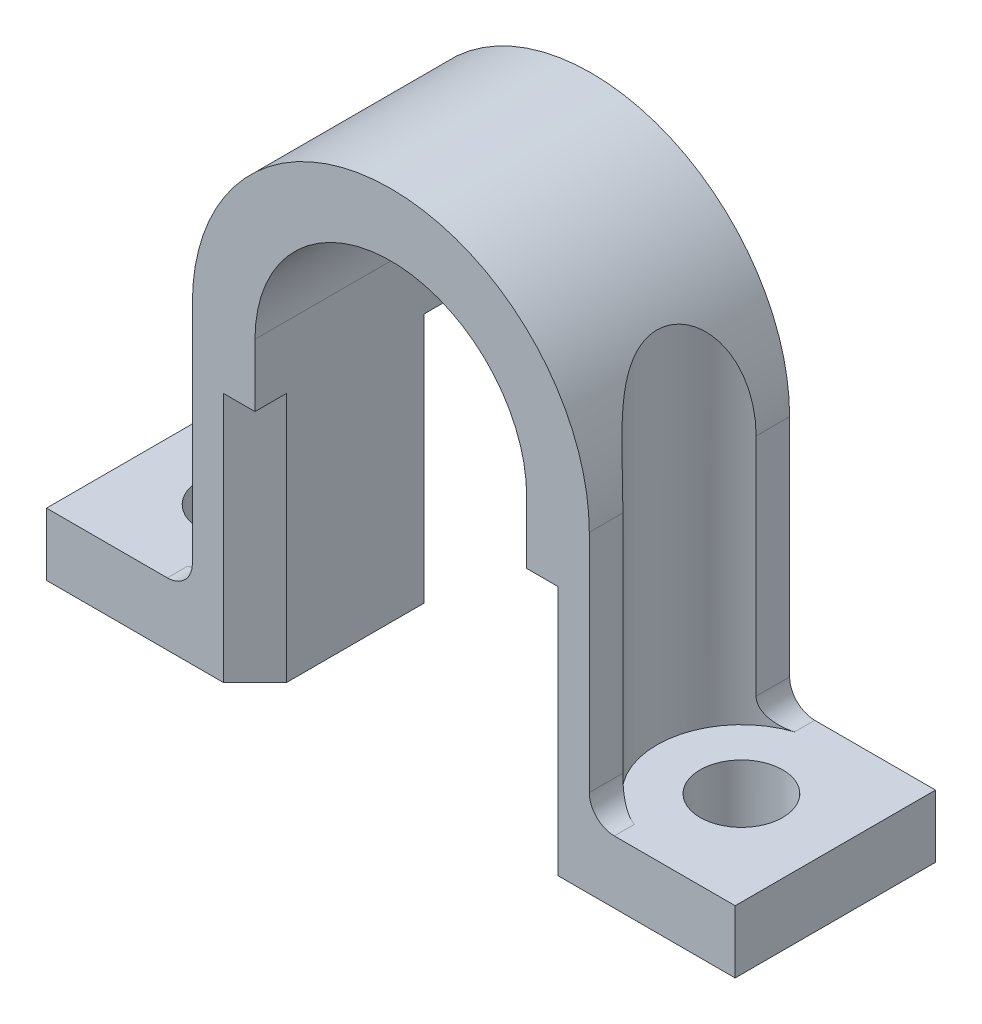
ISO-10303-21;
HEADER;
FILE_DESCRIPTION(('STEP AP214'),'2;1');
FILE_NAME('part.step','',(''),(''),'','','');
FILE_SCHEMA(('AUTOMOTIVE_DESIGN { 1 0 10303 214 1 1 1 1 }'));
ENDSEC;
DATA;
#1=APPLICATION_CONTEXT('core data for automotive mechanical design processes');
#2=APPLICATION_PROTOCOL_DEFINITION('international standard','automotive_design',2000,#1);
#3=PRODUCT_CONTEXT('',#1,'mechanical');
#4=PRODUCT('Part','Part','',(#3));
#5=PRODUCT_RELATED_PRODUCT_CATEGORY('part','',(#4));
#6=PRODUCT_DEFINITION_FORMATION('','',#4);
#7=PRODUCT_DEFINITION_CONTEXT('part definition',#1,'design');
#8=PRODUCT_DEFINITION('design','',#6,#7);
#9=PRODUCT_DEFINITION_SHAPE('','',#8);
#10=(LENGTH_UNIT() NAMED_UNIT(*) SI_UNIT(.MILLI.,.METRE.));
#11=(NAMED_UNIT(*) PLANE_ANGLE_UNIT() SI_UNIT($,.RADIAN.));
#12=(NAMED_UNIT(*) SI_UNIT($,.STERADIAN.) SOLID_ANGLE_UNIT());
#13=UNCERTAINTY_MEASURE_WITH_UNIT(LENGTH_MEASURE(1.E-05),#10,'distance_accuracy_value','');
#14=(GEOMETRIC_REPRESENTATION_CONTEXT(3) GLOBAL_UNCERTAINTY_ASSIGNED_CONTEXT((#13)) GLOBAL_UNIT_ASSIGNED_CONTEXT((#10,
#11,#12)) REPRESENTATION_CONTEXT('',''));
#15=CARTESIAN_POINT('',(0.,0.,0.));
#16=DIRECTION('',(0.,0.,1.));
#17=DIRECTION('',(1.,0.,0.));
#18=AXIS2_PLACEMENT_3D('',#15,#16,#17);
#19=CARTESIAN_POINT('',(15.85,0.,16.));
#20=DIRECTION('',(1.,0.,0.));
#21=DIRECTION('',(0.,1.,0.));
#22=AXIS2_PLACEMENT_3D('',#19,#20,#21);
#23=PLANE('',#22);
#24=DIRECTION('',(0.,0.,-1.));
#25=VECTOR('',#24,1.);
#26=CARTESIAN_POINT('',(15.85,7.,16.));
#27=LINE('',#26,#25);
#28=CARTESIAN_POINT('',(15.85,7.,16.));
#29=VERTEX_POINT('',#28);
#30=CARTESIAN_POINT('',(15.85,7.,13.3235326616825));
#31=VERTEX_POINT('',#30);
#32=EDGE_CURVE('E332',#29,#31,#27,.T.);
#33=ORIENTED_EDGE('',*,*,#32,.T.);
#34=DIRECTION('',(0.,-1.,0.));
#35=VECTOR('',#34,1.);
#36=CARTESIAN_POINT('',(15.85,40.85,13.3235326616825));
#37=LINE('',#36,#35);
#38=CARTESIAN_POINT('',(15.85,25.,13.3235326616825));
#39=VERTEX_POINT('',#38);
#40=EDGE_CURVE('E408',#31,#39,#37,.F.);
#41=ORIENTED_EDGE('',*,*,#40,.T.);
#42=DIRECTION('',(0.,0.,-1.));
#43=VECTOR('',#42,1.);
#44=CARTESIAN_POINT('',(15.85,25.,16.));
#45=LINE('',#44,#43);
#46=CARTESIAN_POINT('',(15.85,25.,16.));
#47=VERTEX_POINT('',#46);
#48=EDGE_CURVE('E327',#47,#39,#45,.T.);
#49=ORIENTED_EDGE('',*,*,#48,.F.);
#50=DIRECTION('',(0.,-1.,0.));
#51=VECTOR('',#50,1.);
#52=CARTESIAN_POINT('',(15.85,0.,16.));
#53=LINE('',#52,#51);
#54=EDGE_CURVE('E302',#47,#29,#53,.T.);
#55=ORIENTED_EDGE('',*,*,#54,.T.);
#56=EDGE_LOOP('',(#33,#41,#49,#55));
#57=FACE_BOUND('',#56,.T.);
#58=ADVANCED_FACE('F40',(#57),#23,.T.);
#59=CARTESIAN_POINT('',(15.85,25.,2.67646733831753));
#60=VERTEX_POINT('',#59);
#61=CARTESIAN_POINT('',(15.85,25.,0.));
#62=VERTEX_POINT('',#61);
#63=EDGE_CURVE('E326',#60,#62,#45,.T.);
#64=ORIENTED_EDGE('',*,*,#63,.F.);
#65=DIRECTION('',(0.,-1.,0.));
#66=VECTOR('',#65,1.);
#67=CARTESIAN_POINT('',(15.85,40.85,2.67646733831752));
#68=LINE('',#67,#66);
#69=CARTESIAN_POINT('',(15.85,7.,2.67646733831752));
#70=VERTEX_POINT('',#69);
#71=EDGE_CURVE('E407',#60,#70,#68,.T.);
#72=ORIENTED_EDGE('',*,*,#71,.T.);
#73=DIRECTION('',(0.,0.,-1.));
#74=VECTOR('',#73,1.);
#75=CARTESIAN_POINT('',(15.85,7.,16.));
#76=LINE('',#75,#74);
#77=CARTESIAN_POINT('',(15.85,7.,0.));
#78=VERTEX_POINT('',#77);
#79=EDGE_CURVE('E330',#70,#78,#76,.T.);
#80=ORIENTED_EDGE('',*,*,#79,.T.);
#81=DIRECTION('',(0.,-1.,0.));
#82=VECTOR('',#81,1.);
#83=CARTESIAN_POINT('',(15.85,0.,0.));
#84=LINE('',#83,#82);
#85=EDGE_CURVE('E269',#62,#78,#84,.T.);
#86=ORIENTED_EDGE('',*,*,#85,.F.);
#87=EDGE_LOOP('',(#64,#72,#80,#86));
#88=FACE_BOUND('',#87,.T.);
#89=ADVANCED_FACE('F396',(#88),#23,.T.);
#90=CARTESIAN_POINT('',(0.,25.,16.));
#91=DIRECTION('',(0.,0.,-1.));
#92=DIRECTION('',(-1.,0.,0.));
#93=AXIS2_PLACEMENT_3D('',#90,#91,#92);
#94=CYLINDRICAL_SURFACE('',#93,15.85);
#95=CARTESIAN_POINT('',(-15.85,25.,13.3235326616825));
#96=CARTESIAN_POINT('',(-15.849998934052,25.2846023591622,13.3235351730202));
#97=CARTESIAN_POINT('',(-15.8423265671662,25.5692515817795,13.3175782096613));
#98=CARTESIAN_POINT('',(-15.811703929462,26.1373102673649,13.2934911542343));
#99=CARTESIAN_POINT('',(-15.7887473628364,26.4207191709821,13.2753560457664));
#100=CARTESIAN_POINT('',(-15.7277384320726,26.985323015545,13.2260717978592));
#101=CARTESIAN_POINT('',(-15.6896580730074,27.2665128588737,13.1948985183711));
#102=CARTESIAN_POINT('',(-15.5988630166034,27.8245035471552,13.1182065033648));
#103=CARTESIAN_POINT('',(-15.5461520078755,28.1013054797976,13.0726913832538));
#104=CARTESIAN_POINT('',(-15.4366803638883,28.603634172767,12.9742420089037));
#105=CARTESIAN_POINT('',(-15.3820152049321,28.8300998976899,12.9237629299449));
#106=CARTESIAN_POINT('',(-15.2636625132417,29.2774544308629,12.8100263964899));
#107=CARTESIAN_POINT('',(-15.1999743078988,29.4983428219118,12.7467679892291));
#108=CARTESIAN_POINT('',(-15.0646496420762,29.9325923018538,12.6059029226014));
#109=CARTESIAN_POINT('',(-14.9930264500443,30.1459651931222,12.5283200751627));
#110=CARTESIAN_POINT('',(-14.8431105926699,30.5636065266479,12.3568298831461));
#111=CARTESIAN_POINT('',(-14.7648205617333,30.7678785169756,12.2629289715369));
#112=CARTESIAN_POINT('',(-14.6279224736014,31.1048138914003,12.0879806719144));
#113=CARTESIAN_POINT('',(-14.5705332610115,31.2404305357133,12.0116512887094));
#114=CARTESIAN_POINT('',(-14.4543031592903,31.5051126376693,11.8493781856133));
#115=CARTESIAN_POINT('',(-14.3954626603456,31.6341798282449,11.7634370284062));
#116=CARTESIAN_POINT('',(-14.2774092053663,31.8845634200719,11.5813685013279));
#117=CARTESIAN_POINT('',(-14.2181966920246,32.0058876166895,11.4852516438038));
#118=CARTESIAN_POINT('',(-14.1006314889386,32.2396018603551,11.2823347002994));
#119=CARTESIAN_POINT('',(-14.0422785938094,32.3519940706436,11.1755372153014));
#120=CARTESIAN_POINT('',(-13.8961233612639,32.6259931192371,10.8885084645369));
#121=CARTESIAN_POINT('',(-13.8098921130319,32.7804198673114,10.700342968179));
#122=CARTESIAN_POINT('',(-13.6896449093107,32.9889082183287,10.3986824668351));
#123=CARTESIAN_POINT('',(-13.6510646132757,33.0545687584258,10.2948451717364));
#124=CARTESIAN_POINT('',(-13.5778021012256,33.1774618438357,10.0810152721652));
#125=CARTESIAN_POINT('',(-13.5431178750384,33.2346987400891,9.9710258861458));
#126=CARTESIAN_POINT('',(-13.4781891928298,33.3405528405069,9.74428448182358));
#127=CARTESIAN_POINT('',(-13.4479921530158,33.3890789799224,9.62747623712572));
#128=CARTESIAN_POINT('',(-13.3933142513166,33.4761002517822,9.38894264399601));
#129=CARTESIAN_POINT('',(-13.3688304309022,33.5146005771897,9.26721987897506));
#130=CARTESIAN_POINT('',(-13.3263127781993,33.5809932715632,9.0198712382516));
#131=CARTESIAN_POINT('',(-13.3082758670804,33.6088907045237,8.89424725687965));
#132=CARTESIAN_POINT('',(-13.2792187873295,33.6536446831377,8.64025603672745));
#133=CARTESIAN_POINT('',(-13.2681973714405,33.6705031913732,8.51188928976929));
#134=CARTESIAN_POINT('',(-13.2546233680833,33.6912359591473,8.27297070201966));
#135=CARTESIAN_POINT('',(-13.2510551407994,33.6966682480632,8.16260829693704));
#136=CARTESIAN_POINT('',(-13.2493482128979,33.6992686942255,7.94174872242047));
#137=CARTESIAN_POINT('',(-13.2512090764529,33.6964375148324,7.83125156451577));
#138=CARTESIAN_POINT('',(-13.2603162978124,33.6825446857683,7.61102782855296));
#139=CARTESIAN_POINT('',(-13.2675611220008,33.6714853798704,7.50130104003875));
#140=CARTESIAN_POINT('',(-13.2872461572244,33.641290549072,7.2834653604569));
#141=CARTESIAN_POINT('',(-13.2996863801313,33.6221550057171,7.1753564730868));
#142=CARTESIAN_POINT('',(-13.3428645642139,33.5553057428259,6.86561914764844));
#143=CARTESIAN_POINT('',(-13.3800106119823,33.4973475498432,6.66697561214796));
#144=CARTESIAN_POINT('',(-13.4690619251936,33.355465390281,6.28292489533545));
#145=CARTESIAN_POINT('',(-13.5209690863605,33.2715380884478,6.09751941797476));
#146=CARTESIAN_POINT('',(-13.640680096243,33.0727237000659,5.72791591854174));
#147=CARTESIAN_POINT('',(-13.7094501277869,32.9558349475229,5.54511461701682));
#148=CARTESIAN_POINT('',(-13.8552311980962,32.6991432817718,5.20009237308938));
#149=CARTESIAN_POINT('',(-13.9322470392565,32.5593269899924,5.03788354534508));
#150=CARTESIAN_POINT('',(-14.0726788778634,32.2938034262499,4.76779497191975));
#151=CARTESIAN_POINT('',(-14.1353451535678,32.1717922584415,4.65582564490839));
#152=CARTESIAN_POINT('',(-14.2613153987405,31.9179085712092,4.4439922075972));
#153=CARTESIAN_POINT('',(-14.3246196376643,31.7860317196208,4.34413346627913));
#154=CARTESIAN_POINT('',(-14.4504872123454,31.5137136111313,4.15574827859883));
#155=CARTESIAN_POINT('',(-14.5130489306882,31.3732567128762,4.06724349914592));
#156=CARTESIAN_POINT('',(-14.6361402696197,31.0852652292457,3.90095066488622));
#157=CARTESIAN_POINT('',(-14.6966692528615,30.9377284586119,3.8231659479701));
#158=CARTESIAN_POINT('',(-14.8418947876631,30.5674316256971,3.6439418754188));
#159=CARTESIAN_POINT('',(-14.9248971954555,30.3412939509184,3.54808563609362));
#160=CARTESIAN_POINT('',(-15.0823036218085,29.8791707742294,3.37480224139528));
#161=CARTESIAN_POINT('',(-15.156703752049,29.6431808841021,3.29738340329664));
#162=CARTESIAN_POINT('',(-15.2954670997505,29.1633672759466,3.15856302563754));
#163=CARTESIAN_POINT('',(-15.3598181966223,28.9195345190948,3.09718076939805));
#164=CARTESIAN_POINT('',(-15.477349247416,28.4261515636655,2.98856184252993));
#165=CARTESIAN_POINT('',(-15.5305294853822,28.1766015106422,2.94132481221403));
#166=CARTESIAN_POINT('',(-15.6399800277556,27.5936542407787,2.84640211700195));
#167=CARTESIAN_POINT('',(-15.6919135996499,27.2586872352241,2.80329430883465));
#168=CARTESIAN_POINT('',(-15.7742944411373,26.5841960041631,2.73609410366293));
#169=CARTESIAN_POINT('',(-15.8047352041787,26.2446704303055,2.71200746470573));
#170=CARTESIAN_POINT('',(-15.8436777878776,25.5630782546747,2.68134393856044));
#171=CARTESIAN_POINT('',(-15.8521471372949,25.2210086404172,2.67479296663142));
#172=CARTESIAN_POINT('',(-15.8469306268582,24.5371879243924,2.67886070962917));
#173=CARTESIAN_POINT('',(-15.833247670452,24.1954367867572,2.68947717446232));
#174=CARTESIAN_POINT('',(-15.7837247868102,23.5117352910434,2.72870589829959));
#175=CARTESIAN_POINT('',(-15.7477045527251,23.1698061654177,2.75746463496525));
#176=CARTESIAN_POINT('',(-15.6539243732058,22.4911039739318,2.83494126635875));
#177=CARTESIAN_POINT('',(-15.5961579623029,22.1543324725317,2.88366509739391));
#178=CARTESIAN_POINT('',(-15.4601738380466,21.4900198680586,3.00392673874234));
#179=CARTESIAN_POINT('',(-15.3820181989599,21.1624540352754,3.07539544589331));
#180=CARTESIAN_POINT('',(-15.2509557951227,20.6804341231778,3.20284186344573));
#181=CARTESIAN_POINT('',(-15.2049756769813,20.521351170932,3.2486850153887));
#182=CARTESIAN_POINT('',(-15.1087728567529,20.2068286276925,3.34777668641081));
#183=CARTESIAN_POINT('',(-15.0585509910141,20.0513883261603,3.40102374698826));
#184=CARTESIAN_POINT('',(-14.951192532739,19.73561075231,3.51906452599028));
#185=CARTESIAN_POINT('',(-14.8938218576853,19.5755392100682,3.58435934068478));
#186=CARTESIAN_POINT('',(-14.7755609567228,19.261229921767,3.7249359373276));
#187=CARTESIAN_POINT('',(-14.7146718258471,19.1069903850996,3.80021462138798));
#188=CARTESIAN_POINT('',(-14.5903315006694,18.8055458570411,3.96163958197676));
#189=CARTESIAN_POINT('',(-14.5268827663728,18.658334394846,4.04777558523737));
#190=CARTESIAN_POINT('',(-14.3985770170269,18.3721715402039,4.23182552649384));
#191=CARTESIAN_POINT('',(-14.3337202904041,18.2332184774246,4.32973707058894));
#192=CARTESIAN_POINT('',(-14.1662636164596,17.887004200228,4.59885916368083));
#193=CARTESIAN_POINT('',(-14.0636291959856,17.6869641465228,4.77960398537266));
#194=CARTESIAN_POINT('',(-13.8658811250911,17.3186217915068,5.17446520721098));
#195=CARTESIAN_POINT('',(-13.7707579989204,17.1502791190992,5.38853851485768));
#196=CARTESIAN_POINT('',(-13.6138827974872,16.8818634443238,5.80469425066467));
#197=CARTESIAN_POINT('',(-13.5492310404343,16.7748873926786,6.00116656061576));
#198=CARTESIAN_POINT('',(-13.46431727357,16.6371314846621,6.30921374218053));
#199=CARTESIAN_POINT('',(-13.4380163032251,16.5949868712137,6.41415796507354));
#200=CARTESIAN_POINT('',(-13.3900162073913,16.518726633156,6.62792511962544));
#201=CARTESIAN_POINT('',(-13.3683151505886,16.4846076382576,6.73674640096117));
#202=CARTESIAN_POINT('',(-13.3299214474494,16.4246298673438,6.95823930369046));
#203=CARTESIAN_POINT('',(-13.3132600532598,16.3988225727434,7.07093031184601));
#204=CARTESIAN_POINT('',(-13.285559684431,16.3560973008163,7.29861957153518));
#205=CARTESIAN_POINT('',(-13.2745182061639,16.3391753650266,7.41361677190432));
#206=CARTESIAN_POINT('',(-13.2583442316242,16.3144356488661,7.64499814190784));
#207=CARTESIAN_POINT('',(-13.2532115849,16.3066176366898,7.76138227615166));
#208=CARTESIAN_POINT('',(-13.248995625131,16.3001936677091,7.99450750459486));
#209=CARTESIAN_POINT('',(-13.2499118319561,16.3015869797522,8.11124856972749));
#210=CARTESIAN_POINT('',(-13.2573976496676,16.313001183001,8.33307510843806));
#211=CARTESIAN_POINT('',(-13.2634262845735,16.3221965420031,8.4382220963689));
#212=CARTESIAN_POINT('',(-13.2802810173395,16.3480139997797,8.6472210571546));
#213=CARTESIAN_POINT('',(-13.2911086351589,16.3646384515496,8.75107260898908));
#214=CARTESIAN_POINT('',(-13.3304608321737,16.4254019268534,9.05949479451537));
#215=CARTESIAN_POINT('',(-13.36586362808,16.4804439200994,9.26117374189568));
#216=CARTESIAN_POINT('',(-13.4526849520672,16.6182114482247,9.65419062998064));
#217=CARTESIAN_POINT('',(-13.5043160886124,16.7013056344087,9.84534921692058));
#218=CARTESIAN_POINT('',(-13.6195546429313,16.8918166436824,10.2111634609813));
#219=CARTESIAN_POINT('',(-13.6831675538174,16.9992446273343,10.3858114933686));
#220=CARTESIAN_POINT('',(-13.8465778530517,17.284325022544,10.7860677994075));
#221=CARTESIAN_POINT('',(-13.9503918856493,17.4725681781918,11.0024971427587));
#222=CARTESIAN_POINT('',(-14.1636073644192,17.8818507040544,11.3985174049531));
#223=CARTESIAN_POINT('',(-14.2730191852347,18.1029525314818,11.578036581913));
#224=CARTESIAN_POINT('',(-14.4578482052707,18.5017992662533,11.8556647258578));
#225=CARTESIAN_POINT('',(-14.533907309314,18.6734798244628,11.9622735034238));
#226=CARTESIAN_POINT('',(-14.6827426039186,19.0270336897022,12.1598789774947));
#227=CARTESIAN_POINT('',(-14.7555174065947,19.2089112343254,12.2508691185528));
#228=CARTESIAN_POINT('',(-14.8962666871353,19.5811958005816,12.4188729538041));
#229=CARTESIAN_POINT('',(-14.9642319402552,19.771618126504,12.495860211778));
#230=CARTESIAN_POINT('',(-15.0940535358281,20.159147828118,12.6371739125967));
#231=CARTESIAN_POINT('',(-15.1559081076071,20.3562571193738,12.7014966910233));
#232=CARTESIAN_POINT('',(-15.2981383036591,20.8432158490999,12.8445037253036));
#233=CARTESIAN_POINT('',(-15.374787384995,21.1359332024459,12.9171709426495));
#234=CARTESIAN_POINT('',(-15.5118813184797,21.7293841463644,13.0426078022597));
#235=CARTESIAN_POINT('',(-15.5723175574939,22.0301219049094,13.0953668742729));
#236=CARTESIAN_POINT('',(-15.6758207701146,22.63660037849,13.1834909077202));
#237=CARTESIAN_POINT('',(-15.7189121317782,22.9423334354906,13.2188803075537));
#238=CARTESIAN_POINT('',(-15.7872053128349,23.5570146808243,13.2741630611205));
#239=CARTESIAN_POINT('',(-15.8124172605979,23.865960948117,13.2940651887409));
#240=CARTESIAN_POINT('',(-15.8356940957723,24.3128322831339,13.3123549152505));
#241=CARTESIAN_POINT('',(-15.8410580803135,24.450196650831,13.3165516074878));
#242=CARTESIAN_POINT('',(-15.8482107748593,24.7250370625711,13.3221394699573));
#243=CARTESIAN_POINT('',(-15.8500005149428,24.8625130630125,13.3235314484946));
#244=CARTESIAN_POINT('',(-15.85,25.,13.3235326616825));
#245=B_SPLINE_CURVE_WITH_KNOTS('',3,(#95,#96,#97,#98,#99,#100,#101,#102,#103,#104,#105,#106,
#107,#108,#109,#110,#111,#112,#113,#114,#115,#116,#117,#118,#119,#120,#121,#122,#123,#124,#125,
#126,#127,#128,#129,#130,#131,#132,#133,#134,#135,#136,#137,#138,#139,#140,#141,#142,#143,#144,
#145,#146,#147,#148,#149,#150,#151,#152,#153,#154,#155,#156,#157,#158,#159,#160,#161,#162,#163,
#164,#165,#166,#167,#168,#169,#170,#171,#172,#173,#174,#175,#176,#177,#178,#179,#180,#181,#182,
#183,#184,#185,#186,#187,#188,#189,#190,#191,#192,#193,#194,#195,#196,#197,#198,#199,#200,#201,
#202,#203,#204,#205,#206,#207,#208,#209,#210,#211,#212,#213,#214,#215,#216,#217,#218,#219,#220,
#221,#222,#223,#224,#225,#226,#227,#228,#229,#230,#231,#232,#233,#234,#235,#236,#237,#238,#239,
#240,#241,#242,#243,#244),.UNSPECIFIED.,.T.,.F.,(4,2,2,2,2,2,2,2,2,2,2,2,2,2,2,2,2,2,2,2,2,2,2,
2,2,2,2,2,2,2,2,2,2,2,2,2,2,2,2,2,2,2,2,2,2,2,2,2,2,2,2,2,2,2,2,2,2,2,2,2,2,2,2,2,2,2,2,2,2,2,2,
2,2,2,4),(0.,0.853721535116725,1.70779494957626,2.56345672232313,3.41890296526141,
4.13351078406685,4.84817190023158,5.56165553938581,6.27485854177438,6.77209589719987,
7.26920099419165,7.76579746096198,8.26227328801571,9.03346697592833,9.41939305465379,
9.80511909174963,10.194668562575,10.5840158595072,10.973176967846,11.3622688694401,
11.6935007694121,12.0247060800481,12.3558170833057,12.6869288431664,13.3146733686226,
13.9424985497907,14.6228096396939,15.303519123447,15.8339999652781,16.364715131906,
16.8964284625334,17.4283069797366,18.2049051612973,18.9818530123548,19.7597308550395,
20.5375889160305,21.5613221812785,22.5853652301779,23.6109208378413,24.6363420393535,
25.6701501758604,26.7042659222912,27.7352693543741,28.250533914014,28.7656971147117,
29.3117687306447,29.8576713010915,30.4030611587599,30.9483403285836,31.810444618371,
32.6714433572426,33.366875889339,33.7148335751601,34.0626448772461,34.4125707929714,
34.7623406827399,35.1121016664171,35.4618348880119,35.7786055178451,36.0954765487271,
36.7285038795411,37.3701968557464,38.0121847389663,38.9222877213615,39.8341432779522,
40.4810973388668,41.1283222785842,41.7767567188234,42.4253785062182,43.3575928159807,
44.2903013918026,45.2216938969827,46.1525583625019,46.565096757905,46.9775162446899),.UNSPECIFIED.);
#246=CARTESIAN_POINT('',(-15.85,25.,13.3235326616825));
#247=VERTEX_POINT('',#246);
#248=CARTESIAN_POINT('',(-15.85,25.,2.67646733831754));
#249=VERTEX_POINT('',#248);
#250=EDGE_CURVE('E380',#247,#249,#245,.T.);
#251=ORIENTED_EDGE('',*,*,#250,.F.);
#252=DIRECTION('',(0.,0.,-1.));
#253=VECTOR('',#252,1.);
#254=CARTESIAN_POINT('',(-15.85,25.,16.));
#255=LINE('',#254,#253);
#256=CARTESIAN_POINT('',(-15.85,25.,16.));
#257=VERTEX_POINT('',#256);
#258=EDGE_CURVE('E323',#257,#247,#255,.T.);
#259=ORIENTED_EDGE('',*,*,#258,.F.);
#260=CARTESIAN_POINT('',(0.,25.,16.));
#261=DIRECTION('',(0.,0.,1.));
#262=DIRECTION('',(1.,0.,0.));
#263=AXIS2_PLACEMENT_3D('',#260,#261,#262);
#264=CIRCLE('',#263,15.85);
#265=EDGE_CURVE('E550',#47,#257,#264,.T.);
#266=ORIENTED_EDGE('',*,*,#265,.F.);
#267=ORIENTED_EDGE('',*,*,#48,.T.);
#268=CARTESIAN_POINT('',(15.85,25.,13.3235326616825));
#269=CARTESIAN_POINT('',(15.849998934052,24.7153976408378,13.3235351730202));
#270=CARTESIAN_POINT('',(15.8423265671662,24.4307484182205,13.3175782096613));
#271=CARTESIAN_POINT('',(15.811703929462,23.8626897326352,13.2934911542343));
#272=CARTESIAN_POINT('',(15.7887473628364,23.5792808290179,13.2753560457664));
#273=CARTESIAN_POINT('',(15.7277384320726,23.014676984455,13.2260717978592));
#274=CARTESIAN_POINT('',(15.6896580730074,22.7334871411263,13.1948985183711));
#275=CARTESIAN_POINT('',(15.5988630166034,22.1754964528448,13.1182065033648));
#276=CARTESIAN_POINT('',(15.5461520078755,21.8986945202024,13.0726913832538));
#277=CARTESIAN_POINT('',(15.4366803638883,21.396365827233,12.9742420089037));
#278=CARTESIAN_POINT('',(15.3820152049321,21.1699001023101,12.9237629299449));
#279=CARTESIAN_POINT('',(15.2636625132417,20.7225455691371,12.8100263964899));
#280=CARTESIAN_POINT('',(15.1999743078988,20.5016571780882,12.7467679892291));
#281=CARTESIAN_POINT('',(15.0646496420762,20.0674076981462,12.6059029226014));
#282=CARTESIAN_POINT('',(14.9930264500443,19.8540348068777,12.5283200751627));
#283=CARTESIAN_POINT('',(14.8431105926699,19.436393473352,12.3568298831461));
#284=CARTESIAN_POINT('',(14.7648205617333,19.2321214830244,12.2629289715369));
#285=CARTESIAN_POINT('',(14.6279224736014,18.8951861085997,12.0879806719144));
#286=CARTESIAN_POINT('',(14.5705332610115,18.7595694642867,12.0116512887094));
#287=CARTESIAN_POINT('',(14.4543031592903,18.4948873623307,11.8493781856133));
#288=CARTESIAN_POINT('',(14.3954626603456,18.3658201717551,11.7634370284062));
#289=CARTESIAN_POINT('',(14.2774092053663,18.1154365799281,11.5813685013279));
#290=CARTESIAN_POINT('',(14.2181966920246,17.9941123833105,11.4852516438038));
#291=CARTESIAN_POINT('',(14.1006314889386,17.7603981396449,11.2823347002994));
#292=CARTESIAN_POINT('',(14.0422785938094,17.6480059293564,11.1755372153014));
#293=CARTESIAN_POINT('',(13.8961233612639,17.3740068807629,10.8885084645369));
#294=CARTESIAN_POINT('',(13.8098921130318,17.2195801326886,10.700342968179));
#295=CARTESIAN_POINT('',(13.6896449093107,17.0110917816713,10.3986824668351));
#296=CARTESIAN_POINT('',(13.6510646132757,16.9454312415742,10.2948451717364));
#297=CARTESIAN_POINT('',(13.5778021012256,16.8225381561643,10.0810152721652));
#298=CARTESIAN_POINT('',(13.5431178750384,16.7653012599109,9.97102588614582));
#299=CARTESIAN_POINT('',(13.4781891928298,16.6594471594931,9.74428448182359));
#300=CARTESIAN_POINT('',(13.4479921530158,16.6109210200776,9.62747623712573));
#301=CARTESIAN_POINT('',(13.3933142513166,16.5238997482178,9.38894264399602));
#302=CARTESIAN_POINT('',(13.3688304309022,16.4853994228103,9.26721987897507));
#303=CARTESIAN_POINT('',(13.3263127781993,16.4190067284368,9.01987123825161));
#304=CARTESIAN_POINT('',(13.3082758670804,16.3911092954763,8.89424725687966));
#305=CARTESIAN_POINT('',(13.2792187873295,16.3463553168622,8.64025603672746));
#306=CARTESIAN_POINT('',(13.2681973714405,16.3294968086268,8.5118892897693));
#307=CARTESIAN_POINT('',(13.2546233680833,16.3087640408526,8.27297070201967));
#308=CARTESIAN_POINT('',(13.2510551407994,16.3033317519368,8.16260829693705));
#309=CARTESIAN_POINT('',(13.2493482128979,16.3007313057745,7.94174872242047));
#310=CARTESIAN_POINT('',(13.2512090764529,16.3035624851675,7.83125156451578));
#311=CARTESIAN_POINT('',(13.2603162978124,16.3174553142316,7.61102782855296));
#312=CARTESIAN_POINT('',(13.2675611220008,16.3285146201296,7.50130104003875));
#313=CARTESIAN_POINT('',(13.2872461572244,16.358709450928,7.2834653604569));
#314=CARTESIAN_POINT('',(13.2996863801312,16.3778449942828,7.1753564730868));
#315=CARTESIAN_POINT('',(13.3428645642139,16.4446942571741,6.86561914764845));
#316=CARTESIAN_POINT('',(13.3800106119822,16.5026524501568,6.66697561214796));
#317=CARTESIAN_POINT('',(13.4690619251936,16.6445346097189,6.28292489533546));
#318=CARTESIAN_POINT('',(13.5209690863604,16.7284619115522,6.09751941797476));
#319=CARTESIAN_POINT('',(13.640680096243,16.9272762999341,5.72791591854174));
#320=CARTESIAN_POINT('',(13.7094501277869,17.0441650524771,5.54511461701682));
#321=CARTESIAN_POINT('',(13.8552311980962,17.3008567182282,5.20009237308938));
#322=CARTESIAN_POINT('',(13.9322470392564,17.4406730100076,5.03788354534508));
#323=CARTESIAN_POINT('',(14.0726788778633,17.70619657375,4.76779497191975));
#324=CARTESIAN_POINT('',(14.1353451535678,17.8282077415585,4.65582564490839));
#325=CARTESIAN_POINT('',(14.2613153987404,18.0820914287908,4.44399220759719));
#326=CARTESIAN_POINT('',(14.3246196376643,18.2139682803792,4.34413346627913));
#327=CARTESIAN_POINT('',(14.4504872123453,18.4862863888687,4.15574827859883));
#328=CARTESIAN_POINT('',(14.5130489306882,18.6267432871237,4.06724349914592));
#329=CARTESIAN_POINT('',(14.6361402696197,18.9147347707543,3.90095066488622));
#330=CARTESIAN_POINT('',(14.6966692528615,19.062271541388,3.82316594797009));
#331=CARTESIAN_POINT('',(14.8418947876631,19.4325683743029,3.64394187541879));
#332=CARTESIAN_POINT('',(14.9248971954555,19.6587060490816,3.54808563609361));
#333=CARTESIAN_POINT('',(15.0823036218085,20.1208292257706,3.37480224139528));
#334=CARTESIAN_POINT('',(15.156703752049,20.3568191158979,3.29738340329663));
#335=CARTESIAN_POINT('',(15.2954670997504,20.8366327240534,3.15856302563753));
#336=CARTESIAN_POINT('',(15.3598181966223,21.0804654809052,3.09718076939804));
#337=CARTESIAN_POINT('',(15.477349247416,21.5738484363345,2.98856184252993));
#338=CARTESIAN_POINT('',(15.5305294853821,21.8233984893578,2.94132481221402));
#339=CARTESIAN_POINT('',(15.6399800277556,22.4063457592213,2.84640211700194));
#340=CARTESIAN_POINT('',(15.6919135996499,22.7413127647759,2.80329430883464));
#341=CARTESIAN_POINT('',(15.7742944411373,23.4158039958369,2.73609410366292));
#342=CARTESIAN_POINT('',(15.8047352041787,23.7553295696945,2.71200746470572));
#343=CARTESIAN_POINT('',(15.8436777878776,24.4369217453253,2.68134393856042));
#344=CARTESIAN_POINT('',(15.8521471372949,24.7789913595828,2.67479296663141));
#345=CARTESIAN_POINT('',(15.8469306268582,25.4628120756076,2.67886070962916));
#346=CARTESIAN_POINT('',(15.833247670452,25.8045632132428,2.6894771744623));
#347=CARTESIAN_POINT('',(15.7837247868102,26.4882647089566,2.72870589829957));
#348=CARTESIAN_POINT('',(15.7477045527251,26.8301938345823,2.75746463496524));
#349=CARTESIAN_POINT('',(15.6539243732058,27.5088960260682,2.83494126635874));
#350=CARTESIAN_POINT('',(15.5961579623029,27.8456675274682,2.8836650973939));
#351=CARTESIAN_POINT('',(15.4601738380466,28.5099801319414,3.00392673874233));
#352=CARTESIAN_POINT('',(15.3820181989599,28.8375459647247,3.07539544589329));
#353=CARTESIAN_POINT('',(15.2509557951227,29.3195658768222,3.20284186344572));
#354=CARTESIAN_POINT('',(15.2049756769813,29.478648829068,3.24868501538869));
#355=CARTESIAN_POINT('',(15.1087728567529,29.7931713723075,3.34777668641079));
#356=CARTESIAN_POINT('',(15.0585509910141,29.9486116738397,3.40102374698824));
#357=CARTESIAN_POINT('',(14.951192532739,30.26438924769,3.51906452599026));
#358=CARTESIAN_POINT('',(14.8938218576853,30.4244607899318,3.58435934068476));
#359=CARTESIAN_POINT('',(14.7755609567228,30.738770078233,3.72493593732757));
#360=CARTESIAN_POINT('',(14.7146718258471,30.8930096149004,3.80021462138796));
#361=CARTESIAN_POINT('',(14.5903315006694,31.1944541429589,3.96163958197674));
#362=CARTESIAN_POINT('',(14.5268827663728,31.341665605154,4.04777558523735));
#363=CARTESIAN_POINT('',(14.3985770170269,31.6278284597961,4.23182552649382));
#364=CARTESIAN_POINT('',(14.3337202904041,31.7667815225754,4.32973707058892));
#365=CARTESIAN_POINT('',(14.1662636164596,32.112995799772,4.59885916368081));
#366=CARTESIAN_POINT('',(14.0636291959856,32.3130358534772,4.77960398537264));
#367=CARTESIAN_POINT('',(13.8658811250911,32.6813782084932,5.17446520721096));
#368=CARTESIAN_POINT('',(13.7707579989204,32.8497208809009,5.38853851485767));
#369=CARTESIAN_POINT('',(13.6138827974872,33.1181365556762,5.80469425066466));
#370=CARTESIAN_POINT('',(13.5492310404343,33.2251126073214,6.00116656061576));
#371=CARTESIAN_POINT('',(13.46431727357,33.3628685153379,6.30921374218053));
#372=CARTESIAN_POINT('',(13.438016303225,33.4050131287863,6.41415796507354));
#373=CARTESIAN_POINT('',(13.3900162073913,33.481273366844,6.62792511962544));
#374=CARTESIAN_POINT('',(13.3683151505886,33.5153923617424,6.73674640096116));
#375=CARTESIAN_POINT('',(13.3299214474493,33.5753701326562,6.95823930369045));
#376=CARTESIAN_POINT('',(13.3132600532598,33.6011774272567,7.07093031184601));
#377=CARTESIAN_POINT('',(13.2855596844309,33.6439026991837,7.29861957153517));
#378=CARTESIAN_POINT('',(13.2745182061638,33.6608246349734,7.41361677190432));
#379=CARTESIAN_POINT('',(13.2583442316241,33.6855643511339,7.64499814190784));
#380=CARTESIAN_POINT('',(13.2532115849,33.6933823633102,7.76138227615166));
#381=CARTESIAN_POINT('',(13.248995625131,33.6998063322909,7.99450750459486));
#382=CARTESIAN_POINT('',(13.2499118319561,33.6984130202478,8.11124856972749));
#383=CARTESIAN_POINT('',(13.2573976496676,33.686998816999,8.33307510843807));
#384=CARTESIAN_POINT('',(13.2634262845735,33.6778034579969,8.43822209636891));
#385=CARTESIAN_POINT('',(13.2802810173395,33.6519860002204,8.64722105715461));
#386=CARTESIAN_POINT('',(13.2911086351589,33.6353615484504,8.75107260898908));
#387=CARTESIAN_POINT('',(13.3304608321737,33.5745980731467,9.05949479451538));
#388=CARTESIAN_POINT('',(13.36586362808,33.5195560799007,9.26117374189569));
#389=CARTESIAN_POINT('',(13.4526849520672,33.3817885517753,9.65419062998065));
#390=CARTESIAN_POINT('',(13.5043160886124,33.2986943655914,9.84534921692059));
#391=CARTESIAN_POINT('',(13.6195546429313,33.1081833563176,10.2111634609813));
#392=CARTESIAN_POINT('',(13.6831675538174,33.0007553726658,10.3858114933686));
#393=CARTESIAN_POINT('',(13.8465778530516,32.715674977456,10.7860677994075));
#394=CARTESIAN_POINT('',(13.9503918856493,32.5274318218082,11.0024971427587));
#395=CARTESIAN_POINT('',(14.1636073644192,32.1181492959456,11.3985174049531));
#396=CARTESIAN_POINT('',(14.2730191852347,31.8970474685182,11.5780365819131));
#397=CARTESIAN_POINT('',(14.4578482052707,31.4982007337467,11.8556647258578));
#398=CARTESIAN_POINT('',(14.5339073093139,31.3265201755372,11.9622735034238));
#399=CARTESIAN_POINT('',(14.6827426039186,30.9729663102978,12.1598789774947));
#400=CARTESIAN_POINT('',(14.7555174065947,30.7910887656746,12.2508691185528));
#401=CARTESIAN_POINT('',(14.8962666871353,30.4188041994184,12.4188729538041));
#402=CARTESIAN_POINT('',(14.9642319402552,30.228381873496,12.495860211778));
#403=CARTESIAN_POINT('',(15.0940535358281,29.840852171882,12.6371739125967));
#404=CARTESIAN_POINT('',(15.1559081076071,29.6437428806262,12.7014966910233));
#405=CARTESIAN_POINT('',(15.2981383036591,29.1567841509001,12.8445037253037));
#406=CARTESIAN_POINT('',(15.374787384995,28.8640667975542,12.9171709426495));
#407=CARTESIAN_POINT('',(15.5118813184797,28.2706158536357,13.0426078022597));
#408=CARTESIAN_POINT('',(15.5723175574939,27.9698780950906,13.0953668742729));
#409=CARTESIAN_POINT('',(15.6758207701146,27.36339962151,13.1834909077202));
#410=CARTESIAN_POINT('',(15.7189121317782,27.0576665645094,13.2188803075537));
#411=CARTESIAN_POINT('',(15.7872053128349,26.4429853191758,13.2741630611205));
#412=CARTESIAN_POINT('',(15.8124172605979,26.134039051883,13.2940651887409));
#413=CARTESIAN_POINT('',(15.8356940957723,25.6871677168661,13.3123549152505));
#414=CARTESIAN_POINT('',(15.8410580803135,25.549803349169,13.3165516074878));
#415=CARTESIAN_POINT('',(15.8482107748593,25.2749629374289,13.3221394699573));
#416=CARTESIAN_POINT('',(15.8500005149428,25.1374869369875,13.3235314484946));
#417=CARTESIAN_POINT('',(15.85,25.,13.3235326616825));
#418=B_SPLINE_CURVE_WITH_KNOTS('',3,(#268,#269,#270,#271,#272,#273,#274,#275,#276,#277,#278,
#279,#280,#281,#282,#283,#284,#285,#286,#287,#288,#289,#290,#291,#292,#293,#294,#295,#296,#297,
#298,#299,#300,#301,#302,#303,#304,#305,#306,#307,#308,#309,#310,#311,#312,#313,#314,#315,#316,
#317,#318,#319,#320,#321,#322,#323,#324,#325,#326,#327,#328,#329,#330,#331,#332,#333,#334,#335,
#336,#337,#338,#339,#340,#341,#342,#343,#344,#345,#346,#347,#348,#349,#350,#351,#352,#353,#354,
#355,#356,#357,#358,#359,#360,#361,#362,#363,#364,#365,#366,#367,#368,#369,#370,#371,#372,#373,
#374,#375,#376,#377,#378,#379,#380,#381,#382,#383,#384,#385,#386,#387,#388,#389,#390,#391,#392,
#393,#394,#395,#396,#397,#398,#399,#400,#401,#402,#403,#404,#405,#406,#407,#408,#409,#410,#411,
#412,#413,#414,#415,#416,#417),.UNSPECIFIED.,.T.,.F.,(4,2,2,2,2,2,2,2,2,2,2,2,2,2,2,2,2,2,2,2,2,
2,2,2,2,2,2,2,2,2,2,2,2,2,2,2,2,2,2,2,2,2,2,2,2,2,2,2,2,2,2,2,2,2,2,2,2,2,2,2,2,2,2,2,2,2,2,2,2,
2,2,2,2,2,4),(0.,0.853721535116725,1.70779494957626,2.56345672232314,3.41890296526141,
4.13351078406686,4.84817190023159,5.56165553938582,6.27485854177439,6.77209589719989,
7.26920099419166,7.76579746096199,8.26227328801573,9.03346697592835,9.41939305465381,
9.80511909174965,10.194668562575,10.5840158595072,10.973176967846,11.3622688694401,
11.6935007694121,12.0247060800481,12.3558170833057,12.6869288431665,13.3146733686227,
13.9424985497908,14.622809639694,15.303519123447,15.8339999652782,16.3647151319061,
16.8964284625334,17.4283069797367,18.2049051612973,18.9818530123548,19.7597308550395,
20.5375889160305,21.5613221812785,22.5853652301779,23.6109208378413,24.6363420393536,
25.6701501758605,26.7042659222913,27.7352693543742,28.2505339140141,28.7656971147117,
29.3117687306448,29.8576713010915,30.4030611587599,30.9483403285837,31.8104446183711,
32.6714433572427,33.3668758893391,33.7148335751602,34.0626448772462,34.4125707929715,
34.76234068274,35.1121016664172,35.461834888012,35.7786055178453,36.0954765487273,
36.7285038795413,37.3701968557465,38.0121847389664,38.9222877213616,39.8341432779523,
40.481097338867,41.1283222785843,41.7767567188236,42.4253785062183,43.3575928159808,
44.2903013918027,45.2216938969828,46.152558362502,46.5650967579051,46.97751624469),.UNSPECIFIED.);
#419=EDGE_CURVE('E401',#60,#39,#418,.T.);
#420=ORIENTED_EDGE('',*,*,#419,.F.);
#421=ORIENTED_EDGE('',*,*,#63,.T.);
#422=CARTESIAN_POINT('',(0.,25.,0.));
#423=DIRECTION('',(0.,0.,1.));
#424=DIRECTION('',(1.,0.,0.));
#425=AXIS2_PLACEMENT_3D('',#422,#423,#424);
#426=CIRCLE('',#425,15.85);
#427=CARTESIAN_POINT('',(-15.85,25.,0.));
#428=VERTEX_POINT('',#427);
#429=EDGE_CURVE('E272',#62,#428,#426,.T.);
#430=ORIENTED_EDGE('',*,*,#429,.T.);
#431=EDGE_CURVE('E322',#249,#428,#255,.T.);
#432=ORIENTED_EDGE('',*,*,#431,.F.);
#433=EDGE_LOOP('',(#251,#259,#266,#267,#420,#421,#430,#432));
#434=FACE_BOUND('',#433,.T.);
#435=ADVANCED_FACE('F390',(#434),#94,.T.);
#436=CARTESIAN_POINT('',(-15.85,0.,16.));
#437=DIRECTION('',(1.,0.,0.));
#438=DIRECTION('',(0.,1.,0.));
#439=AXIS2_PLACEMENT_3D('',#436,#437,#438);
#440=PLANE('',#439);
#441=DIRECTION('',(0.,-1.,0.));
#442=VECTOR('',#441,1.);
#443=CARTESIAN_POINT('',(-15.85,40.85,13.3235326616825));
#444=LINE('',#443,#442);
#445=CARTESIAN_POINT('',(-15.85,7.,13.3235326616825));
#446=VERTEX_POINT('',#445);
#447=EDGE_CURVE('E388',#446,#247,#444,.F.);
#448=ORIENTED_EDGE('',*,*,#447,.F.);
#449=DIRECTION('',(0.,0.,-1.));
#450=VECTOR('',#449,1.);
#451=CARTESIAN_POINT('',(-15.85,7.,16.));
#452=LINE('',#451,#450);
#453=CARTESIAN_POINT('',(-15.85,7.,16.));
#454=VERTEX_POINT('',#453);
#455=EDGE_CURVE('E345',#446,#454,#452,.F.);
#456=ORIENTED_EDGE('',*,*,#455,.T.);
#457=DIRECTION('',(0.,-1.,0.));
#458=VECTOR('',#457,1.);
#459=CARTESIAN_POINT('',(-15.85,0.,16.));
#460=LINE('',#459,#458);
#461=EDGE_CURVE('E553',#257,#454,#460,.T.);
#462=ORIENTED_EDGE('',*,*,#461,.F.);
#463=ORIENTED_EDGE('',*,*,#258,.T.);
#464=EDGE_LOOP('',(#448,#456,#462,#463));
#465=FACE_BOUND('',#464,.T.);
#466=ADVANCED_FACE('F395',(#465),#440,.F.);
#467=DIRECTION('',(0.,-1.,0.));
#468=VECTOR('',#467,1.);
#469=CARTESIAN_POINT('',(-15.85,40.85,2.67646733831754));
#470=LINE('',#469,#468);
#471=CARTESIAN_POINT('',(-15.85,7.,2.67646733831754));
#472=VERTEX_POINT('',#471);
#473=EDGE_CURVE('E387',#249,#472,#470,.T.);
#474=ORIENTED_EDGE('',*,*,#473,.F.);
#475=ORIENTED_EDGE('',*,*,#431,.T.);
#476=DIRECTION('',(0.,-1.,0.));
#477=VECTOR('',#476,1.);
#478=CARTESIAN_POINT('',(-15.85,0.,0.));
#479=LINE('',#478,#477);
#480=CARTESIAN_POINT('',(-15.85,7.,0.));
#481=VERTEX_POINT('',#480);
#482=EDGE_CURVE('E276',#428,#481,#479,.T.);
#483=ORIENTED_EDGE('',*,*,#482,.T.);
#484=DIRECTION('',(0.,0.,-1.));
#485=VECTOR('',#484,1.);
#486=CARTESIAN_POINT('',(-15.85,7.,16.));
#487=LINE('',#486,#485);
#488=EDGE_CURVE('E347',#481,#472,#487,.F.);
#489=ORIENTED_EDGE('',*,*,#488,.T.);
#490=EDGE_LOOP('',(#474,#475,#483,#489));
#491=FACE_BOUND('',#490,.T.);
#492=ADVANCED_FACE('F423',(#491),#440,.F.);
#493=CARTESIAN_POINT('',(17.85,7.,16.));
#494=DIRECTION('',(0.,0.,-1.));
#495=DIRECTION('',(-1.,0.,0.));
#496=AXIS2_PLACEMENT_3D('',#493,#494,#495);
#497=CYLINDRICAL_SURFACE('',#496,2.);
#498=CARTESIAN_POINT('',(17.85,5.,1.60156269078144));
#499=CARTESIAN_POINT('',(17.7894524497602,4.99999563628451,1.6218988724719));
#500=CARTESIAN_POINT('',(17.729215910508,5.00274904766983,1.64310464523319));
#501=CARTESIAN_POINT('',(17.6098203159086,5.01357110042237,1.68703281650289));
#502=CARTESIAN_POINT('',(17.5506606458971,5.02163660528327,1.70975431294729));
#503=CARTESIAN_POINT('',(17.4340210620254,5.04284312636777,1.75642813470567));
#504=CARTESIAN_POINT('',(17.3765356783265,5.05596498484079,1.78037552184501));
#505=CARTESIAN_POINT('',(17.263369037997,5.08706755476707,1.82933075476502));
#506=CARTESIAN_POINT('',(17.2076880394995,5.10504895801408,1.85433875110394));
#507=CARTESIAN_POINT('',(17.0440696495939,5.16588367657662,1.93045559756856));
#508=CARTESIAN_POINT('',(16.9392029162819,5.21569364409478,1.98280042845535));
#509=CARTESIAN_POINT('',(16.7398042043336,5.33241007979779,2.08845071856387));
#510=CARTESIAN_POINT('',(16.6452912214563,5.39934724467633,2.1417577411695));
#511=CARTESIAN_POINT('',(16.4628402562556,5.55397024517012,2.24996115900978));
#512=CARTESIAN_POINT('',(16.3757256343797,5.6427198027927,2.30473658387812));
#513=CARTESIAN_POINT('',(16.2181346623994,5.83698333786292,2.408142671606));
#514=CARTESIAN_POINT('',(16.1476344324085,5.94247288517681,2.45678210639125));
#515=CARTESIAN_POINT('',(16.0423855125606,6.1388937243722,2.53165256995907));
#516=CARTESIAN_POINT('',(16.0031081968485,6.2264394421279,2.5604188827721));
#517=CARTESIAN_POINT('',(15.9371178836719,6.40823997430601,2.60952828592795));
#518=CARTESIAN_POINT('',(15.9103713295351,6.5024760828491,2.62989385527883));
#519=CARTESIAN_POINT('',(15.8772511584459,6.66427229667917,2.65530753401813));
#520=CARTESIAN_POINT('',(15.8670891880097,6.73063546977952,2.6631773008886));
#521=CARTESIAN_POINT('',(15.853438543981,6.86464155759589,2.67378660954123));
#522=CARTESIAN_POINT('',(15.8499695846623,6.93228766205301,2.67651099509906));
#523=CARTESIAN_POINT('',(15.85,7.,2.67646733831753));
#524=B_SPLINE_CURVE_WITH_KNOTS('',3,(#498,#499,#500,#501,#502,#503,#504,#505,#506,#507,#508,
#509,#510,#511,#512,#513,#514,#515,#516,#517,#518,#519,#520,#521,#522,#523),.UNSPECIFIED.,.F.,
.F.,(4,2,2,2,2,2,2,2,2,2,2,2,4),(0.,0.191521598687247,0.382930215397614,0.573620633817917,
0.764338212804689,1.14462476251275,1.52559772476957,1.93126657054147,2.33634874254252,
2.63571221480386,2.93426936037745,3.13655234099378,3.33943024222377),.UNSPECIFIED.);
#525=CARTESIAN_POINT('',(17.85,5.00000000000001,1.60156269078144));
#526=VERTEX_POINT('',#525);
#527=EDGE_CURVE('E411',#526,#70,#524,.T.);
#528=ORIENTED_EDGE('',*,*,#527,.F.);
#529=DIRECTION('',(0.,0.,-1.));
#530=VECTOR('',#529,1.);
#531=CARTESIAN_POINT('',(17.85,5.,16.));
#532=LINE('',#531,#530);
#533=CARTESIAN_POINT('',(17.85,5.,0.));
#534=VERTEX_POINT('',#533);
#535=EDGE_CURVE('E337',#534,#526,#532,.F.);
#536=ORIENTED_EDGE('',*,*,#535,.F.);
#537=CARTESIAN_POINT('',(17.85,7.,0.));
#538=DIRECTION('',(0.,0.,1.));
#539=DIRECTION('',(1.,0.,0.));
#540=AXIS2_PLACEMENT_3D('',#537,#538,#539);
#541=CIRCLE('',#540,2.);
#542=EDGE_CURVE('E350',#78,#534,#541,.T.);
#543=ORIENTED_EDGE('',*,*,#542,.F.);
#544=ORIENTED_EDGE('',*,*,#79,.F.);
#545=EDGE_LOOP('',(#528,#536,#543,#544));
#546=FACE_BOUND('',#545,.T.);
#547=ADVANCED_FACE('F419',(#546),#497,.F.);
#548=CARTESIAN_POINT('',(17.85,7.,16.));
#549=DIRECTION('',(0.,0.,-1.));
#550=DIRECTION('',(-1.,0.,0.));
#551=AXIS2_PLACEMENT_3D('',#548,#549,#550);
#552=CYLINDRICAL_SURFACE('',#551,2.);
#553=CARTESIAN_POINT('',(15.85,7.,13.3235326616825));
#554=CARTESIAN_POINT('',(15.8499891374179,6.95088624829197,13.3235181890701));
#555=CARTESIAN_POINT('',(15.8518087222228,6.90178208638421,13.3249425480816));
#556=CARTESIAN_POINT('',(15.859024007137,6.80403343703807,13.3305586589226));
#557=CARTESIAN_POINT('',(15.8644169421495,6.75538862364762,13.33474827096));
#558=CARTESIAN_POINT('',(15.8786412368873,6.65928111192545,13.3457438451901));
#559=CARTESIAN_POINT('',(15.8874466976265,6.61181230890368,13.352530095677));
#560=CARTESIAN_POINT('',(15.9083474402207,6.51802874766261,13.368524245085));
#561=CARTESIAN_POINT('',(15.9204431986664,6.47171415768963,13.3777324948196));
#562=CARTESIAN_POINT('',(15.9613360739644,6.3352193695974,13.4085915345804));
#563=CARTESIAN_POINT('',(15.9947944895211,6.24712369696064,13.4335210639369));
#564=CARTESIAN_POINT('',(16.0726661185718,6.07816507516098,13.4900689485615));
#565=CARTESIAN_POINT('',(16.1171000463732,5.99731620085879,13.5216999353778));
#566=CARTESIAN_POINT('',(16.2206231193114,5.83584669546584,13.5931347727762));
#567=CARTESIAN_POINT('',(16.2807548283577,5.75612118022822,13.6334461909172));
#568=CARTESIAN_POINT('',(16.4111004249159,5.60739153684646,13.7173696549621));
#569=CARTESIAN_POINT('',(16.4813193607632,5.53839281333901,13.7609833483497));
#570=CARTESIAN_POINT('',(16.644725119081,5.3997292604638,13.8579237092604));
#571=CARTESIAN_POINT('',(16.7397439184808,5.33240793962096,13.9115269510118));
#572=CARTESIAN_POINT('',(16.9403888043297,5.21503703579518,14.0178182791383));
#573=CARTESIAN_POINT('',(17.046010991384,5.16498113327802,14.0705066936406));
#574=CARTESIAN_POINT('',(17.2102751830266,5.10418026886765,14.1468341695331));
#575=CARTESIAN_POINT('',(17.2657898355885,5.08633303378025,14.1717402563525));
#576=CARTESIAN_POINT('',(17.3786068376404,5.05546769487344,14.2204957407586));
#577=CARTESIAN_POINT('',(17.4359089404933,5.0424489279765,14.2443452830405));
#578=CARTESIAN_POINT('',(17.5520898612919,5.02142933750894,14.2907990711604));
#579=CARTESIAN_POINT('',(17.6109721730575,5.01344078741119,14.3134001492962));
#580=CARTESIAN_POINT('',(17.7297999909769,5.00272244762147,14.3571008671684));
#581=CARTESIAN_POINT('',(17.7897460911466,4.99999569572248,14.3781996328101));
#582=CARTESIAN_POINT('',(17.85,5.,14.3984373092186));
#583=B_SPLINE_CURVE_WITH_KNOTS('',3,(#553,#554,#555,#556,#557,#558,#559,#560,#561,#562,#563,
#564,#565,#566,#567,#568,#569,#570,#571,#572,#573,#574,#575,#576,#577,#578,#579,#580,#581,#582),
.UNSPECIFIED.,.F.,.F.,(4,2,2,2,2,2,2,2,2,2,2,2,2,2,4),(0.,0.147271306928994,0.294428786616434,
0.440490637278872,0.586573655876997,0.877640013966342,1.16925996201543,1.49115559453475,
1.81321289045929,2.19619853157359,2.57904384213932,2.76909201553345,2.95911408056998,
3.14959801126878,3.34019188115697),.UNSPECIFIED.);
#584=CARTESIAN_POINT('',(17.85,5.,14.3984373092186));
#585=VERTEX_POINT('',#584);
#586=EDGE_CURVE('E11',#31,#585,#583,.T.);
#587=ORIENTED_EDGE('',*,*,#586,.F.);
#588=ORIENTED_EDGE('',*,*,#32,.F.);
#589=CARTESIAN_POINT('',(17.85,7.,16.));
#590=DIRECTION('',(0.,0.,1.));
#591=DIRECTION('',(1.,0.,0.));
#592=AXIS2_PLACEMENT_3D('',#589,#590,#591);
#593=CIRCLE('',#592,2.);
#594=CARTESIAN_POINT('',(17.85,5.,16.));
#595=VERTEX_POINT('',#594);
#596=EDGE_CURVE('E352',#595,#29,#593,.F.);
#597=ORIENTED_EDGE('',*,*,#596,.F.);
#598=DIRECTION('',(0.,0.,-1.));
#599=VECTOR('',#598,1.);
#600=CARTESIAN_POINT('',(17.85,5.,16.));
#601=LINE('',#600,#599);
#602=EDGE_CURVE('E335',#585,#595,#601,.F.);
#603=ORIENTED_EDGE('',*,*,#602,.F.);
#604=EDGE_LOOP('',(#587,#588,#597,#603));
#605=FACE_BOUND('',#604,.T.);
#606=ADVANCED_FACE('F422',(#605),#552,.F.);
#607=CARTESIAN_POINT('',(-17.85,7.,16.));
#608=DIRECTION('',(0.,0.,-1.));
#609=DIRECTION('',(-1.,0.,0.));
#610=AXIS2_PLACEMENT_3D('',#607,#608,#609);
#611=CYLINDRICAL_SURFACE('',#610,2.);
#612=CARTESIAN_POINT('',(-15.85,7.,2.67646733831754));
#613=CARTESIAN_POINT('',(-15.8499891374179,6.95088624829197,2.67648181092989));
#614=CARTESIAN_POINT('',(-15.8518087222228,6.90178208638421,2.67505745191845));
#615=CARTESIAN_POINT('',(-15.859024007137,6.80403343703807,2.66944134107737));
#616=CARTESIAN_POINT('',(-15.8644169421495,6.75538862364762,2.66525172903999));
#617=CARTESIAN_POINT('',(-15.8786412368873,6.65928111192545,2.65425615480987));
#618=CARTESIAN_POINT('',(-15.8874466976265,6.61181230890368,2.647469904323));
#619=CARTESIAN_POINT('',(-15.9083474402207,6.51802874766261,2.63147575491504));
#620=CARTESIAN_POINT('',(-15.9204431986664,6.47171415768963,2.62226750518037));
#621=CARTESIAN_POINT('',(-15.9613360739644,6.3352193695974,2.59140846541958));
#622=CARTESIAN_POINT('',(-15.9947944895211,6.24712369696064,2.56647893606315));
#623=CARTESIAN_POINT('',(-16.0726661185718,6.07816507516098,2.50993105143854));
#624=CARTESIAN_POINT('',(-16.1171000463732,5.99731620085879,2.47830006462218));
#625=CARTESIAN_POINT('',(-16.2206231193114,5.83584669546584,2.4068652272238));
#626=CARTESIAN_POINT('',(-16.2807548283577,5.75612118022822,2.36655380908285));
#627=CARTESIAN_POINT('',(-16.4111004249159,5.60739153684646,2.28263034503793));
#628=CARTESIAN_POINT('',(-16.4813193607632,5.53839281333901,2.2390166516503));
#629=CARTESIAN_POINT('',(-16.644725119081,5.3997292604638,2.14207629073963));
#630=CARTESIAN_POINT('',(-16.7397439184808,5.33240793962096,2.08847304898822));
#631=CARTESIAN_POINT('',(-16.9403888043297,5.21503703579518,1.98218172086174));
#632=CARTESIAN_POINT('',(-17.046010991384,5.16498113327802,1.92949330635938));
#633=CARTESIAN_POINT('',(-17.2102751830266,5.10418026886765,1.85316583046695));
#634=CARTESIAN_POINT('',(-17.2657898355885,5.08633303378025,1.82825974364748));
#635=CARTESIAN_POINT('',(-17.3786068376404,5.05546769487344,1.77950425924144));
#636=CARTESIAN_POINT('',(-17.4359089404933,5.0424489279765,1.7556547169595));
#637=CARTESIAN_POINT('',(-17.5520898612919,5.02142933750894,1.70920092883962));
#638=CARTESIAN_POINT('',(-17.6109721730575,5.01344078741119,1.68659985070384));
#639=CARTESIAN_POINT('',(-17.7297999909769,5.00272244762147,1.64289913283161));
#640=CARTESIAN_POINT('',(-17.7897460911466,4.99999569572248,1.62180036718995));
#641=CARTESIAN_POINT('',(-17.85,5.,1.60156269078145));
#642=B_SPLINE_CURVE_WITH_KNOTS('',3,(#612,#613,#614,#615,#616,#617,#618,#619,#620,#621,#622,
#623,#624,#625,#626,#627,#628,#629,#630,#631,#632,#633,#634,#635,#636,#637,#638,#639,#640,#641),
.UNSPECIFIED.,.F.,.F.,(4,2,2,2,2,2,2,2,2,2,2,2,2,2,4),(0.,0.147271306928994,0.294428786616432,
0.44049063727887,0.586573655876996,0.877640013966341,1.16925996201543,1.49115559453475,
1.81321289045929,2.19619853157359,2.57904384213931,2.76909201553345,2.95911408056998,
3.14959801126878,3.34019188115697),.UNSPECIFIED.);
#643=CARTESIAN_POINT('',(-17.85,5.,1.60156269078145));
#644=VERTEX_POINT('',#643);
#645=EDGE_CURVE('E449',#472,#644,#642,.T.);
#646=ORIENTED_EDGE('',*,*,#645,.F.);
#647=ORIENTED_EDGE('',*,*,#488,.F.);
#648=CARTESIAN_POINT('',(-17.85,7.,0.));
#649=DIRECTION('',(0.,0.,1.));
#650=DIRECTION('',(1.,0.,0.));
#651=AXIS2_PLACEMENT_3D('',#648,#649,#650);
#652=CIRCLE('',#651,2.);
#653=CARTESIAN_POINT('',(-17.85,5.,0.));
#654=VERTEX_POINT('',#653);
#655=EDGE_CURVE('E354',#654,#481,#652,.T.);
#656=ORIENTED_EDGE('',*,*,#655,.F.);
#657=DIRECTION('',(0.,0.,-1.));
#658=VECTOR('',#657,1.);
#659=CARTESIAN_POINT('',(-17.85,5.,16.));
#660=LINE('',#659,#658);
#661=EDGE_CURVE('E340',#644,#654,#660,.T.);
#662=ORIENTED_EDGE('',*,*,#661,.F.);
#663=EDGE_LOOP('',(#646,#647,#656,#662));
#664=FACE_BOUND('',#663,.T.);
#665=ADVANCED_FACE('F42',(#664),#611,.F.);
#666=CARTESIAN_POINT('',(-17.85,7.,16.));
#667=DIRECTION('',(0.,0.,-1.));
#668=DIRECTION('',(-1.,0.,0.));
#669=AXIS2_PLACEMENT_3D('',#666,#667,#668);
#670=CYLINDRICAL_SURFACE('',#669,2.);
#671=CARTESIAN_POINT('',(-17.85,5.,14.3984373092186));
#672=CARTESIAN_POINT('',(-17.7894524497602,4.99999563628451,14.3781011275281));
#673=CARTESIAN_POINT('',(-17.729215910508,5.00274904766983,14.3568953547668));
#674=CARTESIAN_POINT('',(-17.6098203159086,5.01357110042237,14.3129671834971));
#675=CARTESIAN_POINT('',(-17.5506606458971,5.02163660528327,14.2902456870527));
#676=CARTESIAN_POINT('',(-17.4340210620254,5.04284312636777,14.2435718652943));
#677=CARTESIAN_POINT('',(-17.3765356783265,5.05596498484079,14.219624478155));
#678=CARTESIAN_POINT('',(-17.263369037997,5.08706755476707,14.170669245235));
#679=CARTESIAN_POINT('',(-17.2076880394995,5.10504895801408,14.1456612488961));
#680=CARTESIAN_POINT('',(-17.0440696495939,5.16588367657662,14.0695444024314));
#681=CARTESIAN_POINT('',(-16.9392029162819,5.21569364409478,14.0171995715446));
#682=CARTESIAN_POINT('',(-16.7398042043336,5.33241007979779,13.9115492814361));
#683=CARTESIAN_POINT('',(-16.6452912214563,5.39934724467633,13.8582422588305));
#684=CARTESIAN_POINT('',(-16.4628402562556,5.55397024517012,13.7500388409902));
#685=CARTESIAN_POINT('',(-16.3757256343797,5.64271980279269,13.6952634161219));
#686=CARTESIAN_POINT('',(-16.2181346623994,5.83698333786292,13.591857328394));
#687=CARTESIAN_POINT('',(-16.1476344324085,5.94247288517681,13.5432178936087));
#688=CARTESIAN_POINT('',(-16.0423855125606,6.1388937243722,13.4683474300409));
#689=CARTESIAN_POINT('',(-16.0031081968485,6.2264394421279,13.4395811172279));
#690=CARTESIAN_POINT('',(-15.9371178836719,6.40823997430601,13.390471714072));
#691=CARTESIAN_POINT('',(-15.9103713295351,6.5024760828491,13.3701061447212));
#692=CARTESIAN_POINT('',(-15.8772511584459,6.66427229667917,13.3446924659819));
#693=CARTESIAN_POINT('',(-15.8670891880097,6.73063546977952,13.3368226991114));
#694=CARTESIAN_POINT('',(-15.853438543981,6.86464155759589,13.3262133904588));
#695=CARTESIAN_POINT('',(-15.8499695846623,6.93228766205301,13.3234890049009));
#696=CARTESIAN_POINT('',(-15.85,7.,13.3235326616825));
#697=B_SPLINE_CURVE_WITH_KNOTS('',3,(#671,#672,#673,#674,#675,#676,#677,#678,#679,#680,#681,
#682,#683,#684,#685,#686,#687,#688,#689,#690,#691,#692,#693,#694,#695,#696),.UNSPECIFIED.,.F.,
.F.,(4,2,2,2,2,2,2,2,2,2,2,2,4),(0.,0.191521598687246,0.382930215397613,0.573620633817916,
0.764338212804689,1.14462476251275,1.52559772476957,1.93126657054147,2.33634874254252,
2.63571221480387,2.93426936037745,3.13655234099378,3.33943024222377),.UNSPECIFIED.);
#698=CARTESIAN_POINT('',(-17.85,5.,14.3984373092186));
#699=VERTEX_POINT('',#698);
#700=EDGE_CURVE('E55',#699,#446,#697,.T.);
#701=ORIENTED_EDGE('',*,*,#700,.F.);
#702=DIRECTION('',(0.,0.,-1.));
#703=VECTOR('',#702,1.);
#704=CARTESIAN_POINT('',(-17.85,5.,16.));
#705=LINE('',#704,#703);
#706=CARTESIAN_POINT('',(-17.85,5.,16.));
#707=VERTEX_POINT('',#706);
#708=EDGE_CURVE('E342',#707,#699,#705,.T.);
#709=ORIENTED_EDGE('',*,*,#708,.F.);
#710=CARTESIAN_POINT('',(-17.85,7.,16.));
#711=DIRECTION('',(0.,0.,1.));
#712=DIRECTION('',(1.,0.,0.));
#713=AXIS2_PLACEMENT_3D('',#710,#711,#712);
#714=CIRCLE('',#713,2.);
#715=EDGE_CURVE('E356',#454,#707,#714,.F.);
#716=ORIENTED_EDGE('',*,*,#715,.F.);
#717=ORIENTED_EDGE('',*,*,#455,.F.);
#718=EDGE_LOOP('',(#701,#709,#716,#717));
#719=FACE_BOUND('',#718,.T.);
#720=ADVANCED_FACE('F362',(#719),#670,.F.);
#721=CARTESIAN_POINT('',(0.,5.,16.));
#722=DIRECTION('',(0.,1.,0.));
#723=DIRECTION('',(-1.,0.,0.));
#724=AXIS2_PLACEMENT_3D('',#721,#722,#723);
#725=PLANE('',#724);
#726=ORIENTED_EDGE('',*,*,#708,.T.);
#727=CARTESIAN_POINT('',(-20.,5.,8.));
#728=DIRECTION('',(0.,1.,0.));
#729=DIRECTION('',(-1.,0.,0.));
#730=AXIS2_PLACEMENT_3D('',#727,#728,#729);
#731=CIRCLE('',#730,6.75);
#732=EDGE_CURVE('E476',#699,#644,#731,.T.);
#733=ORIENTED_EDGE('',*,*,#732,.T.);
#734=ORIENTED_EDGE('',*,*,#661,.T.);
#735=DIRECTION('',(1.,0.,0.));
#736=VECTOR('',#735,1.);
#737=CARTESIAN_POINT('',(0.,5.,0.));
#738=LINE('',#737,#736);
#739=CARTESIAN_POINT('',(-27.5,4.99999999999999,0.));
#740=VERTEX_POINT('',#739);
#741=EDGE_CURVE('E279',#740,#654,#738,.T.);
#742=ORIENTED_EDGE('',*,*,#741,.F.);
#743=DIRECTION('',(0.,0.,-1.));
#744=VECTOR('',#743,1.);
#745=CARTESIAN_POINT('',(-27.5,4.99999999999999,16.));
#746=LINE('',#745,#744);
#747=CARTESIAN_POINT('',(-27.5,4.99999999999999,16.));
#748=VERTEX_POINT('',#747);
#749=EDGE_CURVE('E320',#748,#740,#746,.T.);
#750=ORIENTED_EDGE('',*,*,#749,.F.);
#751=DIRECTION('',(1.,0.,0.));
#752=VECTOR('',#751,1.);
#753=CARTESIAN_POINT('',(0.,5.,16.));
#754=LINE('',#753,#752);
#755=EDGE_CURVE('E561',#748,#707,#754,.T.);
#756=ORIENTED_EDGE('',*,*,#755,.T.);
#757=EDGE_LOOP('',(#726,#733,#734,#742,#750,#756));
#758=FACE_BOUND('',#757,.T.);
#759=CARTESIAN_POINT('',(-20.,5.,8.));
#760=DIRECTION('',(0.,1.,0.));
#761=DIRECTION('',(-1.,0.,0.));
#762=AXIS2_PLACEMENT_3D('',#759,#760,#761);
#763=CIRCLE('',#762,3.3);
#764=CARTESIAN_POINT('',(-23.3,5.,8.));
#765=VERTEX_POINT('',#764);
#766=EDGE_CURVE('E858',#765,#765,#763,.F.);
#767=ORIENTED_EDGE('',*,*,#766,.T.);
#768=EDGE_LOOP('',(#767));
#769=FACE_BOUND('',#768,.T.);
#770=ADVANCED_FACE('F472',(#758,#769),#725,.T.);
#771=CARTESIAN_POINT('',(-27.5,0.,16.));
#772=DIRECTION('',(-1.,0.,0.));
#773=DIRECTION('',(0.,0.,1.));
#774=AXIS2_PLACEMENT_3D('',#771,#772,#773);
#775=PLANE('',#774);
#776=DIRECTION('',(0.,1.,0.));
#777=VECTOR('',#776,1.);
#778=CARTESIAN_POINT('',(-27.5,0.,0.));
#779=LINE('',#778,#777);
#780=CARTESIAN_POINT('',(-27.5,0.,0.));
#781=VERTEX_POINT('',#780);
#782=EDGE_CURVE('E282',#781,#740,#779,.T.);
#783=ORIENTED_EDGE('',*,*,#782,.F.);
#784=DIRECTION('',(0.,0.,-1.));
#785=VECTOR('',#784,1.);
#786=CARTESIAN_POINT('',(-27.5,0.,16.));
#787=LINE('',#786,#785);
#788=CARTESIAN_POINT('',(-27.5,0.,16.));
#789=VERTEX_POINT('',#788);
#790=EDGE_CURVE('E317',#789,#781,#787,.T.);
#791=ORIENTED_EDGE('',*,*,#790,.F.);
#792=DIRECTION('',(0.,1.,0.));
#793=VECTOR('',#792,1.);
#794=CARTESIAN_POINT('',(-27.5,0.,16.));
#795=LINE('',#794,#793);
#796=EDGE_CURVE('E563',#789,#748,#795,.T.);
#797=ORIENTED_EDGE('',*,*,#796,.T.);
#798=ORIENTED_EDGE('',*,*,#749,.T.);
#799=EDGE_LOOP('',(#783,#791,#797,#798));
#800=FACE_BOUND('',#799,.T.);
#801=ADVANCED_FACE('F622',(#800),#775,.T.);
#802=CARTESIAN_POINT('',(0.,0.,16.));
#803=DIRECTION('',(0.,-1.,0.));
#804=DIRECTION('',(0.,0.,-1.));
#805=AXIS2_PLACEMENT_3D('',#802,#803,#804);
#806=PLANE('',#805);
#807=DIRECTION('',(-0.707106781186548,0.,-0.707106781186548));
#808=VECTOR('',#807,1.);
#809=CARTESIAN_POINT('',(-13.35,0.,0.));
#810=LINE('',#809,#808);
#811=CARTESIAN_POINT('',(-10.85,0.,2.5));
#812=VERTEX_POINT('',#811);
#813=CARTESIAN_POINT('',(-13.35,0.,0.));
#814=VERTEX_POINT('',#813);
#815=EDGE_CURVE('E501',#812,#814,#810,.T.);
#816=ORIENTED_EDGE('',*,*,#815,.F.);
#817=DIRECTION('',(0.,0.,-1.));
#818=VECTOR('',#817,1.);
#819=CARTESIAN_POINT('',(-10.85,0.,16.));
#820=LINE('',#819,#818);
#821=CARTESIAN_POINT('',(-10.85,0.,13.5));
#822=VERTEX_POINT('',#821);
#823=EDGE_CURVE('E314',#822,#812,#820,.T.);
#824=ORIENTED_EDGE('',*,*,#823,.F.);
#825=DIRECTION('',(0.707106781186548,0.,-0.707106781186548));
#826=VECTOR('',#825,1.);
#827=CARTESIAN_POINT('',(-13.35,0.,16.));
#828=LINE('',#827,#826);
#829=CARTESIAN_POINT('',(-13.35,0.,16.));
#830=VERTEX_POINT('',#829);
#831=EDGE_CURVE('E487',#830,#822,#828,.T.);
#832=ORIENTED_EDGE('',*,*,#831,.F.);
#833=DIRECTION('',(-1.,0.,0.));
#834=VECTOR('',#833,1.);
#835=CARTESIAN_POINT('',(0.,0.,16.));
#836=LINE('',#835,#834);
#837=EDGE_CURVE('E259',#830,#789,#836,.T.);
#838=ORIENTED_EDGE('',*,*,#837,.T.);
#839=ORIENTED_EDGE('',*,*,#790,.T.);
#840=DIRECTION('',(-1.,0.,0.));
#841=VECTOR('',#840,1.);
#842=CARTESIAN_POINT('',(0.,0.,0.));
#843=LINE('',#842,#841);
#844=EDGE_CURVE('E285',#814,#781,#843,.T.);
#845=ORIENTED_EDGE('',*,*,#844,.F.);
#846=EDGE_LOOP('',(#816,#824,#832,#838,#839,#845));
#847=FACE_BOUND('',#846,.T.);
#848=CARTESIAN_POINT('',(-20.,0.,8.));
#849=DIRECTION('',(0.,-1.,0.));
#850=DIRECTION('',(0.,0.,-1.));
#851=AXIS2_PLACEMENT_3D('',#848,#849,#850);
#852=CIRCLE('',#851,3.3);
#853=CARTESIAN_POINT('',(-20.,0.,4.7));
#854=VERTEX_POINT('',#853);
#855=EDGE_CURVE('E273',#854,#854,#852,.T.);
#856=ORIENTED_EDGE('',*,*,#855,.F.);
#857=EDGE_LOOP('',(#856));
#858=FACE_BOUND('',#857,.T.);
#859=ADVANCED_FACE('F613',(#847,#858),#806,.T.);
#860=CARTESIAN_POINT('',(-10.85,0.,16.));
#861=DIRECTION('',(1.,0.,0.));
#862=DIRECTION('',(0.,1.,0.));
#863=AXIS2_PLACEMENT_3D('',#860,#861,#862);
#864=PLANE('',#863);
#865=DIRECTION('',(0.,-1.,0.));
#866=VECTOR('',#865,1.);
#867=CARTESIAN_POINT('',(-10.85,20.,2.5));
#868=LINE('',#867,#866);
#869=CARTESIAN_POINT('',(-10.85,20.,2.5));
#870=VERTEX_POINT('',#869);
#871=EDGE_CURVE('E494',#870,#812,#868,.T.);
#872=ORIENTED_EDGE('',*,*,#871,.F.);
#873=DIRECTION('',(0.,0.,1.));
#874=VECTOR('',#873,1.);
#875=CARTESIAN_POINT('',(-10.85,20.,2.5));
#876=LINE('',#875,#874);
#877=CARTESIAN_POINT('',(-10.85,20.,0.));
#878=VERTEX_POINT('',#877);
#879=EDGE_CURVE('E505',#878,#870,#876,.T.);
#880=ORIENTED_EDGE('',*,*,#879,.F.);
#881=DIRECTION('',(0.,-1.,0.));
#882=VECTOR('',#881,1.);
#883=CARTESIAN_POINT('',(-10.85,0.,0.));
#884=LINE('',#883,#882);
#885=CARTESIAN_POINT('',(-10.85,25.,0.));
#886=VERTEX_POINT('',#885);
#887=EDGE_CURVE('E287',#886,#878,#884,.T.);
#888=ORIENTED_EDGE('',*,*,#887,.F.);
#889=DIRECTION('',(0.,0.,-1.));
#890=VECTOR('',#889,1.);
#891=CARTESIAN_POINT('',(-10.85,25.,16.));
#892=LINE('',#891,#890);
#893=CARTESIAN_POINT('',(-10.85,25.,16.));
#894=VERTEX_POINT('',#893);
#895=EDGE_CURVE('E312',#894,#886,#892,.T.);
#896=ORIENTED_EDGE('',*,*,#895,.F.);
#897=DIRECTION('',(0.,-1.,0.));
#898=VECTOR('',#897,1.);
#899=CARTESIAN_POINT('',(-10.85,0.,16.));
#900=LINE('',#899,#898);
#901=CARTESIAN_POINT('',(-10.85,20.,16.));
#902=VERTEX_POINT('',#901);
#903=EDGE_CURVE('E260',#894,#902,#900,.T.);
#904=ORIENTED_EDGE('',*,*,#903,.T.);
#905=DIRECTION('',(0.,0.,1.));
#906=VECTOR('',#905,1.);
#907=CARTESIAN_POINT('',(-10.85,20.,13.5));
#908=LINE('',#907,#906);
#909=CARTESIAN_POINT('',(-10.85,20.,13.5));
#910=VERTEX_POINT('',#909);
#911=EDGE_CURVE('E70',#910,#902,#908,.T.);
#912=ORIENTED_EDGE('',*,*,#911,.F.);
#913=DIRECTION('',(0.,-1.,0.));
#914=VECTOR('',#913,1.);
#915=CARTESIAN_POINT('',(-10.85,20.,13.5));
#916=LINE('',#915,#914);
#917=EDGE_CURVE('E480',#910,#822,#916,.T.);
#918=ORIENTED_EDGE('',*,*,#917,.T.);
#919=ORIENTED_EDGE('',*,*,#823,.T.);
#920=EDGE_LOOP('',(#872,#880,#888,#896,#904,#912,#918,#919));
#921=FACE_BOUND('',#920,.T.);
#922=ADVANCED_FACE('F568',(#921),#864,.T.);
#923=CARTESIAN_POINT('',(0.,25.,16.));
#924=DIRECTION('',(0.,0.,-1.));
#925=DIRECTION('',(-1.,0.,0.));
#926=AXIS2_PLACEMENT_3D('',#923,#924,#925);
#927=CYLINDRICAL_SURFACE('',#926,10.85);
#928=CARTESIAN_POINT('',(0.,25.,0.));
#929=DIRECTION('',(0.,0.,1.));
#930=DIRECTION('',(1.,0.,0.));
#931=AXIS2_PLACEMENT_3D('',#928,#929,#930);
#932=CIRCLE('',#931,10.85);
#933=CARTESIAN_POINT('',(10.85,25.,0.));
#934=VERTEX_POINT('',#933);
#935=EDGE_CURVE('E291',#934,#886,#932,.T.);
#936=ORIENTED_EDGE('',*,*,#935,.F.);
#937=DIRECTION('',(0.,0.,-1.));
#938=VECTOR('',#937,1.);
#939=CARTESIAN_POINT('',(10.85,25.,16.));
#940=LINE('',#939,#938);
#941=CARTESIAN_POINT('',(10.85,25.,16.));
#942=VERTEX_POINT('',#941);
#943=EDGE_CURVE('E310',#942,#934,#940,.T.);
#944=ORIENTED_EDGE('',*,*,#943,.F.);
#945=CARTESIAN_POINT('',(0.,25.,16.));
#946=DIRECTION('',(0.,0.,1.));
#947=DIRECTION('',(1.,0.,0.));
#948=AXIS2_PLACEMENT_3D('',#945,#946,#947);
#949=CIRCLE('',#948,10.85);
#950=EDGE_CURVE('E253',#942,#894,#949,.T.);
#951=ORIENTED_EDGE('',*,*,#950,.T.);
#952=ORIENTED_EDGE('',*,*,#895,.T.);
#953=EDGE_LOOP('',(#936,#944,#951,#952));
#954=FACE_BOUND('',#953,.T.);
#955=ADVANCED_FACE('F573',(#954),#927,.F.);
#956=CARTESIAN_POINT('',(10.85,0.,16.));
#957=DIRECTION('',(1.,0.,0.));
#958=DIRECTION('',(0.,1.,0.));
#959=AXIS2_PLACEMENT_3D('',#956,#957,#958);
#960=PLANE('',#959);
#961=DIRECTION('',(0.,0.,-1.));
#962=VECTOR('',#961,1.);
#963=CARTESIAN_POINT('',(10.85,20.,2.5));
#964=LINE('',#963,#962);
#965=CARTESIAN_POINT('',(10.85,20.,2.5));
#966=VERTEX_POINT('',#965);
#967=CARTESIAN_POINT('',(10.85,20.,0.));
#968=VERTEX_POINT('',#967);
#969=EDGE_CURVE('E515',#966,#968,#964,.T.);
#970=ORIENTED_EDGE('',*,*,#969,.F.);
#971=DIRECTION('',(0.,-1.,0.));
#972=VECTOR('',#971,1.);
#973=CARTESIAN_POINT('',(10.85,20.,2.5));
#974=LINE('',#973,#972);
#975=CARTESIAN_POINT('',(10.85,0.,2.5));
#976=VERTEX_POINT('',#975);
#977=EDGE_CURVE('E510',#966,#976,#974,.T.);
#978=ORIENTED_EDGE('',*,*,#977,.T.);
#979=DIRECTION('',(0.,0.,-1.));
#980=VECTOR('',#979,1.);
#981=CARTESIAN_POINT('',(10.85,0.,16.));
#982=LINE('',#981,#980);
#983=CARTESIAN_POINT('',(10.85,0.,13.5));
#984=VERTEX_POINT('',#983);
#985=EDGE_CURVE('E307',#984,#976,#982,.T.);
#986=ORIENTED_EDGE('',*,*,#985,.F.);
#987=DIRECTION('',(0.,-1.,0.));
#988=VECTOR('',#987,1.);
#989=CARTESIAN_POINT('',(10.85,20.,13.5));
#990=LINE('',#989,#988);
#991=CARTESIAN_POINT('',(10.85,20.,13.5));
#992=VERTEX_POINT('',#991);
#993=EDGE_CURVE('E248',#992,#984,#990,.T.);
#994=ORIENTED_EDGE('',*,*,#993,.F.);
#995=DIRECTION('',(0.,0.,-1.));
#996=VECTOR('',#995,1.);
#997=CARTESIAN_POINT('',(10.85,20.,13.5));
#998=LINE('',#997,#996);
#999=CARTESIAN_POINT('',(10.85,20.,16.));
#1000=VERTEX_POINT('',#999);
#1001=EDGE_CURVE('E234',#1000,#992,#998,.T.);
#1002=ORIENTED_EDGE('',*,*,#1001,.F.);
#1003=DIRECTION('',(0.,-1.,0.));
#1004=VECTOR('',#1003,1.);
#1005=CARTESIAN_POINT('',(10.85,0.,16.));
#1006=LINE('',#1005,#1004);
#1007=EDGE_CURVE('E245',#942,#1000,#1006,.T.);
#1008=ORIENTED_EDGE('',*,*,#1007,.F.);
#1009=ORIENTED_EDGE('',*,*,#943,.T.);
#1010=DIRECTION('',(0.,-1.,0.));
#1011=VECTOR('',#1010,1.);
#1012=CARTESIAN_POINT('',(10.85,0.,0.));
#1013=LINE('',#1012,#1011);
#1014=EDGE_CURVE('E294',#934,#968,#1013,.T.);
#1015=ORIENTED_EDGE('',*,*,#1014,.T.);
#1016=EDGE_LOOP('',(#970,#978,#986,#994,#1002,#1008,#1009,#1015));
#1017=FACE_BOUND('',#1016,.T.);
#1018=ADVANCED_FACE('F244',(#1017),#960,.F.);
#1019=DIRECTION('',(-0.707106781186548,0.,0.707106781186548));
#1020=VECTOR('',#1019,1.);
#1021=CARTESIAN_POINT('',(13.35,0.,0.));
#1022=LINE('',#1021,#1020);
#1023=CARTESIAN_POINT('',(13.35,0.,0.));
#1024=VERTEX_POINT('',#1023);
#1025=EDGE_CURVE('E500',#1024,#976,#1022,.T.);
#1026=ORIENTED_EDGE('',*,*,#1025,.F.);
#1027=CARTESIAN_POINT('',(27.5,0.,0.));
#1028=VERTEX_POINT('',#1027);
#1029=EDGE_CURVE('E288',#1028,#1024,#843,.T.);
#1030=ORIENTED_EDGE('',*,*,#1029,.F.);
#1031=DIRECTION('',(0.,0.,-1.));
#1032=VECTOR('',#1031,1.);
#1033=CARTESIAN_POINT('',(27.5,0.,16.));
#1034=LINE('',#1033,#1032);
#1035=CARTESIAN_POINT('',(27.5,0.,16.));
#1036=VERTEX_POINT('',#1035);
#1037=EDGE_CURVE('E305',#1036,#1028,#1034,.T.);
#1038=ORIENTED_EDGE('',*,*,#1037,.F.);
#1039=CARTESIAN_POINT('',(13.35,0.,16.));
#1040=VERTEX_POINT('',#1039);
#1041=EDGE_CURVE('E254',#1036,#1040,#836,.T.);
#1042=ORIENTED_EDGE('',*,*,#1041,.T.);
#1043=DIRECTION('',(0.707106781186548,0.,0.707106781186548));
#1044=VECTOR('',#1043,1.);
#1045=CARTESIAN_POINT('',(13.35,0.,16.));
#1046=LINE('',#1045,#1044);
#1047=EDGE_CURVE('E238',#984,#1040,#1046,.T.);
#1048=ORIENTED_EDGE('',*,*,#1047,.F.);
#1049=ORIENTED_EDGE('',*,*,#985,.T.);
#1050=EDGE_LOOP('',(#1026,#1030,#1038,#1042,#1048,#1049));
#1051=FACE_BOUND('',#1050,.T.);
#1052=CARTESIAN_POINT('',(20.,0.,7.99999999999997));
#1053=DIRECTION('',(0.,-1.,0.));
#1054=DIRECTION('',(0.,0.,1.));
#1055=AXIS2_PLACEMENT_3D('',#1052,#1053,#1054);
#1056=CIRCLE('',#1055,3.3);
#1057=CARTESIAN_POINT('',(20.,0.,11.3));
#1058=VERTEX_POINT('',#1057);
#1059=EDGE_CURVE('E417',#1058,#1058,#1056,.T.);
#1060=ORIENTED_EDGE('',*,*,#1059,.F.);
#1061=EDGE_LOOP('',(#1060));
#1062=FACE_BOUND('',#1061,.T.);
#1063=ADVANCED_FACE('F530',(#1051,#1062),#806,.T.);
#1064=CARTESIAN_POINT('',(27.5,0.,16.));
#1065=DIRECTION('',(-1.,0.,0.));
#1066=DIRECTION('',(0.,0.,1.));
#1067=AXIS2_PLACEMENT_3D('',#1064,#1065,#1066);
#1068=PLANE('',#1067);
#1069=DIRECTION('',(0.,1.,0.));
#1070=VECTOR('',#1069,1.);
#1071=CARTESIAN_POINT('',(27.5,0.,0.));
#1072=LINE('',#1071,#1070);
#1073=CARTESIAN_POINT('',(27.5,4.99999999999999,0.));
#1074=VERTEX_POINT('',#1073);
#1075=EDGE_CURVE('E297',#1028,#1074,#1072,.T.);
#1076=ORIENTED_EDGE('',*,*,#1075,.T.);
#1077=DIRECTION('',(0.,0.,-1.));
#1078=VECTOR('',#1077,1.);
#1079=CARTESIAN_POINT('',(27.5,4.99999999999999,16.));
#1080=LINE('',#1079,#1078);
#1081=CARTESIAN_POINT('',(27.5,4.99999999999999,16.));
#1082=VERTEX_POINT('',#1081);
#1083=EDGE_CURVE('E268',#1082,#1074,#1080,.T.);
#1084=ORIENTED_EDGE('',*,*,#1083,.F.);
#1085=DIRECTION('',(0.,1.,0.));
#1086=VECTOR('',#1085,1.);
#1087=CARTESIAN_POINT('',(27.5,0.,16.));
#1088=LINE('',#1087,#1086);
#1089=EDGE_CURVE('E257',#1036,#1082,#1088,.T.);
#1090=ORIENTED_EDGE('',*,*,#1089,.F.);
#1091=ORIENTED_EDGE('',*,*,#1037,.T.);
#1092=EDGE_LOOP('',(#1076,#1084,#1090,#1091));
#1093=FACE_BOUND('',#1092,.T.);
#1094=ADVANCED_FACE('F538',(#1093),#1068,.F.);
#1095=CARTESIAN_POINT('',(0.,5.,16.));
#1096=DIRECTION('',(0.,-1.,0.));
#1097=DIRECTION('',(1.,0.,0.));
#1098=AXIS2_PLACEMENT_3D('',#1095,#1096,#1097);
#1099=PLANE('',#1098);
#1100=ORIENTED_EDGE('',*,*,#535,.T.);
#1101=CARTESIAN_POINT('',(20.,5.00000000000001,8.));
#1102=DIRECTION('',(0.,1.,0.));
#1103=DIRECTION('',(1.,0.,0.));
#1104=AXIS2_PLACEMENT_3D('',#1101,#1102,#1103);
#1105=CIRCLE('',#1104,6.75);
#1106=EDGE_CURVE('E446',#526,#585,#1105,.T.);
#1107=ORIENTED_EDGE('',*,*,#1106,.T.);
#1108=ORIENTED_EDGE('',*,*,#602,.T.);
#1109=DIRECTION('',(-1.,0.,0.));
#1110=VECTOR('',#1109,1.);
#1111=CARTESIAN_POINT('',(0.,5.,16.));
#1112=LINE('',#1111,#1110);
#1113=EDGE_CURVE('E265',#1082,#595,#1112,.T.);
#1114=ORIENTED_EDGE('',*,*,#1113,.F.);
#1115=ORIENTED_EDGE('',*,*,#1083,.T.);
#1116=DIRECTION('',(-1.,0.,0.));
#1117=VECTOR('',#1116,1.);
#1118=CARTESIAN_POINT('',(0.,5.,0.));
#1119=LINE('',#1118,#1117);
#1120=EDGE_CURVE('E299',#1074,#534,#1119,.T.);
#1121=ORIENTED_EDGE('',*,*,#1120,.T.);
#1122=EDGE_LOOP('',(#1100,#1107,#1108,#1114,#1115,#1121));
#1123=FACE_BOUND('',#1122,.T.);
#1124=CARTESIAN_POINT('',(20.,5.,7.99999999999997));
#1125=DIRECTION('',(0.,-1.,0.));
#1126=DIRECTION('',(1.,0.,0.));
#1127=AXIS2_PLACEMENT_3D('',#1124,#1125,#1126);
#1128=CIRCLE('',#1127,3.3);
#1129=CARTESIAN_POINT('',(23.3,5.,7.99999999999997));
#1130=VERTEX_POINT('',#1129);
#1131=EDGE_CURVE('E557',#1130,#1130,#1128,.F.);
#1132=ORIENTED_EDGE('',*,*,#1131,.F.);
#1133=EDGE_LOOP('',(#1132));
#1134=FACE_BOUND('',#1133,.T.);
#1135=ADVANCED_FACE('F541',(#1123,#1134),#1099,.F.);
#1136=CARTESIAN_POINT('',(0.,0.,16.));
#1137=DIRECTION('',(0.,0.,1.));
#1138=DIRECTION('',(1.,0.,0.));
#1139=AXIS2_PLACEMENT_3D('',#1136,#1137,#1138);
#1140=PLANE('',#1139);
#1141=DIRECTION('',(0.,-1.,0.));
#1142=VECTOR('',#1141,1.);
#1143=CARTESIAN_POINT('',(13.35,20.,16.));
#1144=LINE('',#1143,#1142);
#1145=CARTESIAN_POINT('',(13.35,20.,16.));
#1146=VERTEX_POINT('',#1145);
#1147=EDGE_CURVE('E489',#1146,#1040,#1144,.T.);
#1148=ORIENTED_EDGE('',*,*,#1147,.T.);
#1149=ORIENTED_EDGE('',*,*,#1041,.F.);
#1150=ORIENTED_EDGE('',*,*,#1089,.T.);
#1151=ORIENTED_EDGE('',*,*,#1113,.T.);
#1152=ORIENTED_EDGE('',*,*,#596,.T.);
#1153=ORIENTED_EDGE('',*,*,#54,.F.);
#1154=ORIENTED_EDGE('',*,*,#265,.T.);
#1155=ORIENTED_EDGE('',*,*,#461,.T.);
#1156=ORIENTED_EDGE('',*,*,#715,.T.);
#1157=ORIENTED_EDGE('',*,*,#755,.F.);
#1158=ORIENTED_EDGE('',*,*,#796,.F.);
#1159=ORIENTED_EDGE('',*,*,#837,.F.);
#1160=DIRECTION('',(0.,-1.,0.));
#1161=VECTOR('',#1160,1.);
#1162=CARTESIAN_POINT('',(-13.35,20.,16.));
#1163=LINE('',#1162,#1161);
#1164=CARTESIAN_POINT('',(-13.35,20.,16.));
#1165=VERTEX_POINT('',#1164);
#1166=EDGE_CURVE('E482',#1165,#830,#1163,.T.);
#1167=ORIENTED_EDGE('',*,*,#1166,.F.);
#1168=DIRECTION('',(-1.,0.,0.));
#1169=VECTOR('',#1168,1.);
#1170=CARTESIAN_POINT('',(-10.85,20.,16.));
#1171=LINE('',#1170,#1169);
#1172=EDGE_CURVE('E491',#902,#1165,#1171,.T.);
#1173=ORIENTED_EDGE('',*,*,#1172,.F.);
#1174=ORIENTED_EDGE('',*,*,#903,.F.);
#1175=ORIENTED_EDGE('',*,*,#950,.F.);
#1176=ORIENTED_EDGE('',*,*,#1007,.T.);
#1177=DIRECTION('',(-1.,0.,0.));
#1178=VECTOR('',#1177,1.);
#1179=CARTESIAN_POINT('',(10.85,20.,16.));
#1180=LINE('',#1179,#1178);
#1181=EDGE_CURVE('E231',#1146,#1000,#1180,.T.);
#1182=ORIENTED_EDGE('',*,*,#1181,.F.);
#1183=EDGE_LOOP('',(#1148,#1149,#1150,#1151,#1152,#1153,#1154,#1155,#1156,#1157,#1158,#1159,
#1167,#1173,#1174,#1175,#1176,#1182));
#1184=FACE_BOUND('',#1183,.T.);
#1185=ADVANCED_FACE('F250',(#1184),#1140,.T.);
#1186=CARTESIAN_POINT('',(0.,0.,0.));
#1187=DIRECTION('',(0.,0.,1.));
#1188=DIRECTION('',(1.,0.,0.));
#1189=AXIS2_PLACEMENT_3D('',#1186,#1187,#1188);
#1190=PLANE('',#1189);
#1191=DIRECTION('',(1.,0.,0.));
#1192=VECTOR('',#1191,1.);
#1193=CARTESIAN_POINT('',(-10.85,20.,0.));
#1194=LINE('',#1193,#1192);
#1195=CARTESIAN_POINT('',(-13.35,20.,0.));
#1196=VERTEX_POINT('',#1195);
#1197=EDGE_CURVE('E503',#1196,#878,#1194,.T.);
#1198=ORIENTED_EDGE('',*,*,#1197,.F.);
#1199=DIRECTION('',(0.,-1.,0.));
#1200=VECTOR('',#1199,1.);
#1201=CARTESIAN_POINT('',(-13.35,20.,0.));
#1202=LINE('',#1201,#1200);
#1203=EDGE_CURVE('E496',#1196,#814,#1202,.T.);
#1204=ORIENTED_EDGE('',*,*,#1203,.T.);
#1205=ORIENTED_EDGE('',*,*,#844,.T.);
#1206=ORIENTED_EDGE('',*,*,#782,.T.);
#1207=ORIENTED_EDGE('',*,*,#741,.T.);
#1208=ORIENTED_EDGE('',*,*,#655,.T.);
#1209=ORIENTED_EDGE('',*,*,#482,.F.);
#1210=ORIENTED_EDGE('',*,*,#429,.F.);
#1211=ORIENTED_EDGE('',*,*,#85,.T.);
#1212=ORIENTED_EDGE('',*,*,#542,.T.);
#1213=ORIENTED_EDGE('',*,*,#1120,.F.);
#1214=ORIENTED_EDGE('',*,*,#1075,.F.);
#1215=ORIENTED_EDGE('',*,*,#1029,.T.);
#1216=DIRECTION('',(0.,-1.,0.));
#1217=VECTOR('',#1216,1.);
#1218=CARTESIAN_POINT('',(13.35,20.,0.));
#1219=LINE('',#1218,#1217);
#1220=CARTESIAN_POINT('',(13.35,20.,0.));
#1221=VERTEX_POINT('',#1220);
#1222=EDGE_CURVE('E508',#1221,#1024,#1219,.T.);
#1223=ORIENTED_EDGE('',*,*,#1222,.F.);
#1224=DIRECTION('',(1.,0.,0.));
#1225=VECTOR('',#1224,1.);
#1226=CARTESIAN_POINT('',(10.85,20.,0.));
#1227=LINE('',#1226,#1225);
#1228=EDGE_CURVE('E518',#968,#1221,#1227,.T.);
#1229=ORIENTED_EDGE('',*,*,#1228,.F.);
#1230=ORIENTED_EDGE('',*,*,#1014,.F.);
#1231=ORIENTED_EDGE('',*,*,#935,.T.);
#1232=ORIENTED_EDGE('',*,*,#887,.T.);
#1233=EDGE_LOOP('',(#1198,#1204,#1205,#1206,#1207,#1208,#1209,#1210,#1211,#1212,#1213,#1214,
#1215,#1223,#1229,#1230,#1231,#1232));
#1234=FACE_BOUND('',#1233,.T.);
#1235=ADVANCED_FACE('F467',(#1234),#1190,.F.);
#1236=CARTESIAN_POINT('',(20.,40.851,7.99999999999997));
#1237=DIRECTION('',(0.,-1.,0.));
#1238=DIRECTION('',(0.,0.,-1.));
#1239=AXIS2_PLACEMENT_3D('',#1236,#1237,#1238);
#1240=CYLINDRICAL_SURFACE('',#1239,3.3);
#1241=ORIENTED_EDGE('',*,*,#1059,.T.);
#1242=EDGE_LOOP('',(#1241));
#1243=FACE_BOUND('',#1242,.T.);
#1244=ORIENTED_EDGE('',*,*,#1131,.T.);
#1245=EDGE_LOOP('',(#1244));
#1246=FACE_BOUND('',#1245,.T.);
#1247=ADVANCED_FACE('F682',(#1243,#1246),#1240,.F.);
#1248=CARTESIAN_POINT('',(-20.,40.851,8.));
#1249=DIRECTION('',(0.,-1.,0.));
#1250=DIRECTION('',(0.,0.,-1.));
#1251=AXIS2_PLACEMENT_3D('',#1248,#1249,#1250);
#1252=CYLINDRICAL_SURFACE('',#1251,3.3);
#1253=ORIENTED_EDGE('',*,*,#766,.F.);
#1254=EDGE_LOOP('',(#1253));
#1255=FACE_BOUND('',#1254,.T.);
#1256=ORIENTED_EDGE('',*,*,#855,.T.);
#1257=EDGE_LOOP('',(#1256));
#1258=FACE_BOUND('',#1257,.T.);
#1259=ADVANCED_FACE('F370',(#1255,#1258),#1252,.F.);
#1260=CARTESIAN_POINT('',(-20.,40.85,8.));
#1261=DIRECTION('',(0.,-1.,0.));
#1262=DIRECTION('',(1.,0.,0.));
#1263=AXIS2_PLACEMENT_3D('',#1260,#1261,#1262);
#1264=CYLINDRICAL_SURFACE('',#1263,6.75);
#1265=ORIENTED_EDGE('',*,*,#645,.T.);
#1266=ORIENTED_EDGE('',*,*,#732,.F.);
#1267=ORIENTED_EDGE('',*,*,#700,.T.);
#1268=ORIENTED_EDGE('',*,*,#447,.T.);
#1269=ORIENTED_EDGE('',*,*,#250,.T.);
#1270=ORIENTED_EDGE('',*,*,#473,.T.);
#1271=EDGE_LOOP('',(#1265,#1266,#1267,#1268,#1269,#1270));
#1272=FACE_BOUND('',#1271,.T.);
#1273=ADVANCED_FACE('F365',(#1272),#1264,.F.);
#1274=CARTESIAN_POINT('',(20.,40.85,8.));
#1275=DIRECTION('',(0.,-1.,0.));
#1276=DIRECTION('',(1.,0.,0.));
#1277=AXIS2_PLACEMENT_3D('',#1274,#1275,#1276);
#1278=CYLINDRICAL_SURFACE('',#1277,6.75);
#1279=ORIENTED_EDGE('',*,*,#527,.T.);
#1280=ORIENTED_EDGE('',*,*,#71,.F.);
#1281=ORIENTED_EDGE('',*,*,#419,.T.);
#1282=ORIENTED_EDGE('',*,*,#40,.F.);
#1283=ORIENTED_EDGE('',*,*,#586,.T.);
#1284=ORIENTED_EDGE('',*,*,#1106,.F.);
#1285=EDGE_LOOP('',(#1279,#1280,#1281,#1282,#1283,#1284));
#1286=FACE_BOUND('',#1285,.T.);
#1287=ADVANCED_FACE('F369',(#1286),#1278,.F.);
#1288=CARTESIAN_POINT('',(13.35,20.,0.));
#1289=DIRECTION('',(0.707106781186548,0.,0.707106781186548));
#1290=DIRECTION('',(0.707106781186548,0.,-0.707106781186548));
#1291=AXIS2_PLACEMENT_3D('',#1288,#1289,#1290);
#1292=PLANE('',#1291);
#1293=ORIENTED_EDGE('',*,*,#1025,.T.);
#1294=ORIENTED_EDGE('',*,*,#977,.F.);
#1295=DIRECTION('',(-0.707106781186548,0.,0.707106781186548));
#1296=VECTOR('',#1295,1.);
#1297=CARTESIAN_POINT('',(13.35,20.,0.));
#1298=LINE('',#1297,#1296);
#1299=EDGE_CURVE('E511',#1221,#966,#1298,.T.);
#1300=ORIENTED_EDGE('',*,*,#1299,.F.);
#1301=ORIENTED_EDGE('',*,*,#1222,.T.);
#1302=EDGE_LOOP('',(#1293,#1294,#1300,#1301));
#1303=FACE_BOUND('',#1302,.T.);
#1304=ADVANCED_FACE('F581',(#1303),#1292,.F.);
#1305=CARTESIAN_POINT('',(0.,20.,0.));
#1306=DIRECTION('',(0.,-1.,0.));
#1307=DIRECTION('',(0.,0.,-1.));
#1308=AXIS2_PLACEMENT_3D('',#1305,#1306,#1307);
#1309=PLANE('',#1308);
#1310=ORIENTED_EDGE('',*,*,#969,.T.);
#1311=ORIENTED_EDGE('',*,*,#1228,.T.);
#1312=ORIENTED_EDGE('',*,*,#1299,.T.);
#1313=EDGE_LOOP('',(#1310,#1311,#1312));
#1314=FACE_BOUND('',#1313,.T.);
#1315=ADVANCED_FACE('F579',(#1314),#1309,.T.);
#1316=CARTESIAN_POINT('',(-13.35,20.,0.));
#1317=DIRECTION('',(-0.707106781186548,0.,0.707106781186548));
#1318=DIRECTION('',(0.707106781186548,0.,0.707106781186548));
#1319=AXIS2_PLACEMENT_3D('',#1316,#1317,#1318);
#1320=PLANE('',#1319);
#1321=ORIENTED_EDGE('',*,*,#815,.T.);
#1322=ORIENTED_EDGE('',*,*,#1203,.F.);
#1323=DIRECTION('',(-0.707106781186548,0.,-0.707106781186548));
#1324=VECTOR('',#1323,1.);
#1325=CARTESIAN_POINT('',(-13.35,20.,0.));
#1326=LINE('',#1325,#1324);
#1327=EDGE_CURVE('E497',#870,#1196,#1326,.T.);
#1328=ORIENTED_EDGE('',*,*,#1327,.F.);
#1329=ORIENTED_EDGE('',*,*,#871,.T.);
#1330=EDGE_LOOP('',(#1321,#1322,#1328,#1329));
#1331=FACE_BOUND('',#1330,.T.);
#1332=ADVANCED_FACE('F588',(#1331),#1320,.F.);
#1333=CARTESIAN_POINT('',(0.,20.,0.));
#1334=DIRECTION('',(0.,-1.,0.));
#1335=DIRECTION('',(0.,0.,-1.));
#1336=AXIS2_PLACEMENT_3D('',#1333,#1334,#1335);
#1337=PLANE('',#1336);
#1338=ORIENTED_EDGE('',*,*,#1197,.T.);
#1339=ORIENTED_EDGE('',*,*,#879,.T.);
#1340=ORIENTED_EDGE('',*,*,#1327,.T.);
#1341=EDGE_LOOP('',(#1338,#1339,#1340));
#1342=FACE_BOUND('',#1341,.T.);
#1343=ADVANCED_FACE('F592',(#1342),#1337,.T.);
#1344=CARTESIAN_POINT('',(-13.35,20.,16.));
#1345=DIRECTION('',(-0.707106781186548,0.,-0.707106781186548));
#1346=DIRECTION('',(-0.707106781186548,0.,0.707106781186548));
#1347=AXIS2_PLACEMENT_3D('',#1344,#1345,#1346);
#1348=PLANE('',#1347);
#1349=ORIENTED_EDGE('',*,*,#831,.T.);
#1350=ORIENTED_EDGE('',*,*,#917,.F.);
#1351=DIRECTION('',(0.707106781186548,0.,-0.707106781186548));
#1352=VECTOR('',#1351,1.);
#1353=CARTESIAN_POINT('',(-13.35,20.,16.));
#1354=LINE('',#1353,#1352);
#1355=EDGE_CURVE('E484',#1165,#910,#1354,.T.);
#1356=ORIENTED_EDGE('',*,*,#1355,.F.);
#1357=ORIENTED_EDGE('',*,*,#1166,.T.);
#1358=EDGE_LOOP('',(#1349,#1350,#1356,#1357));
#1359=FACE_BOUND('',#1358,.T.);
#1360=ADVANCED_FACE('F372',(#1359),#1348,.F.);
#1361=CARTESIAN_POINT('',(0.,20.,0.));
#1362=DIRECTION('',(0.,-1.,0.));
#1363=DIRECTION('',(0.,0.,-1.));
#1364=AXIS2_PLACEMENT_3D('',#1361,#1362,#1363);
#1365=PLANE('',#1364);
#1366=ORIENTED_EDGE('',*,*,#911,.T.);
#1367=ORIENTED_EDGE('',*,*,#1172,.T.);
#1368=ORIENTED_EDGE('',*,*,#1355,.T.);
#1369=EDGE_LOOP('',(#1366,#1367,#1368));
#1370=FACE_BOUND('',#1369,.T.);
#1371=ADVANCED_FACE('F598',(#1370),#1365,.T.);
#1372=CARTESIAN_POINT('',(13.35,20.,16.));
#1373=DIRECTION('',(0.707106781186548,0.,-0.707106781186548));
#1374=DIRECTION('',(-0.707106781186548,0.,-0.707106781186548));
#1375=AXIS2_PLACEMENT_3D('',#1372,#1373,#1374);
#1376=PLANE('',#1375);
#1377=ORIENTED_EDGE('',*,*,#1047,.T.);
#1378=ORIENTED_EDGE('',*,*,#1147,.F.);
#1379=DIRECTION('',(0.707106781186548,0.,0.707106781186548));
#1380=VECTOR('',#1379,1.);
#1381=CARTESIAN_POINT('',(13.35,20.,16.));
#1382=LINE('',#1381,#1380);
#1383=EDGE_CURVE('E62',#992,#1146,#1382,.T.);
#1384=ORIENTED_EDGE('',*,*,#1383,.F.);
#1385=ORIENTED_EDGE('',*,*,#993,.T.);
#1386=EDGE_LOOP('',(#1377,#1378,#1384,#1385));
#1387=FACE_BOUND('',#1386,.T.);
#1388=ADVANCED_FACE('F526',(#1387),#1376,.F.);
#1389=CARTESIAN_POINT('',(0.,20.,0.));
#1390=DIRECTION('',(0.,-1.,0.));
#1391=DIRECTION('',(0.,0.,-1.));
#1392=AXIS2_PLACEMENT_3D('',#1389,#1390,#1391);
#1393=PLANE('',#1392);
#1394=ORIENTED_EDGE('',*,*,#1181,.T.);
#1395=ORIENTED_EDGE('',*,*,#1001,.T.);
#1396=ORIENTED_EDGE('',*,*,#1383,.T.);
#1397=EDGE_LOOP('',(#1394,#1395,#1396));
#1398=FACE_BOUND('',#1397,.T.);
#1399=ADVANCED_FACE('F233',(#1398),#1393,.T.);
#1400=CLOSED_SHELL('',(#58,#89,#435,#466,#492,#547,#606,#665,#720,#770,#801,#859,#922,#955,
#1018,#1063,#1094,#1135,#1185,#1235,#1247,#1259,#1273,#1287,#1304,#1315,#1332,#1343,#1360,#1371,
#1388,#1399));
#1401=MANIFOLD_SOLID_BREP('B2',#1400);
#1402=ADVANCED_BREP_SHAPE_REPRESENTATION('',(#18,#1401),#14);
#1403=SHAPE_DEFINITION_REPRESENTATION(#9,#1402);
ENDSEC;
END-ISO-10303-21;
